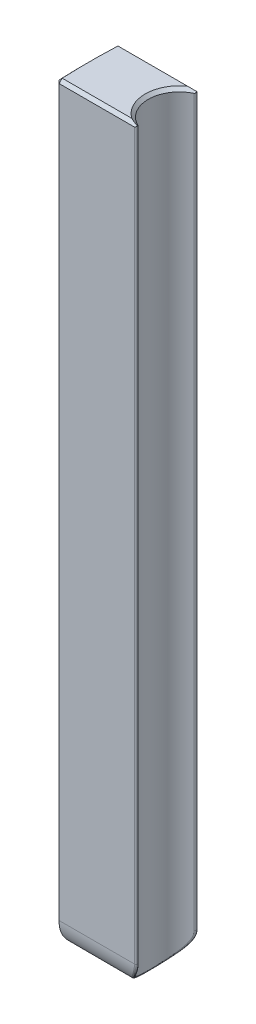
ISO-10303-21;
HEADER;
FILE_DESCRIPTION(('STEP AP214'),'2;1');
FILE_NAME('part.step','',(''),(''),'','','');
FILE_SCHEMA(('AUTOMOTIVE_DESIGN { 1 0 10303 214 1 1 1 1 }'));
ENDSEC;
DATA;
#1=APPLICATION_CONTEXT('core data for automotive mechanical design processes');
#2=APPLICATION_PROTOCOL_DEFINITION('international standard','automotive_design',2000,#1);
#3=PRODUCT_CONTEXT('',#1,'mechanical');
#4=PRODUCT('Part','Part','',(#3));
#5=PRODUCT_RELATED_PRODUCT_CATEGORY('part','',(#4));
#6=PRODUCT_DEFINITION_FORMATION('','',#4);
#7=PRODUCT_DEFINITION_CONTEXT('part definition',#1,'design');
#8=PRODUCT_DEFINITION('design','',#6,#7);
#9=PRODUCT_DEFINITION_SHAPE('','',#8);
#10=(LENGTH_UNIT() NAMED_UNIT(*) SI_UNIT(.MILLI.,.METRE.));
#11=(NAMED_UNIT(*) PLANE_ANGLE_UNIT() SI_UNIT($,.RADIAN.));
#12=(NAMED_UNIT(*) SI_UNIT($,.STERADIAN.) SOLID_ANGLE_UNIT());
#13=UNCERTAINTY_MEASURE_WITH_UNIT(LENGTH_MEASURE(1.E-05),#10,'distance_accuracy_value','');
#14=(GEOMETRIC_REPRESENTATION_CONTEXT(3) GLOBAL_UNCERTAINTY_ASSIGNED_CONTEXT((#13)) GLOBAL_UNIT_ASSIGNED_CONTEXT((#10,
#11,#12)) REPRESENTATION_CONTEXT('',''));
#15=CARTESIAN_POINT('',(0.,0.,0.));
#16=DIRECTION('',(0.,0.,1.));
#17=DIRECTION('',(1.,0.,0.));
#18=AXIS2_PLACEMENT_3D('',#15,#16,#17);
#19=CARTESIAN_POINT('',(3.,0.,0.));
#20=DIRECTION('',(-1.,0.,0.));
#21=DIRECTION('',(0.,0.,1.));
#22=AXIS2_PLACEMENT_3D('',#19,#20,#21);
#23=CYLINDRICAL_SURFACE('',#22,1.);
#24=DIRECTION('',(-1.,0.,0.));
#25=VECTOR('',#24,1.);
#26=CARTESIAN_POINT('',(3.,0.,-1.));
#27=LINE('',#26,#25);
#28=CARTESIAN_POINT('',(2.55278640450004,0.,-1.));
#29=VERTEX_POINT('',#28);
#30=CARTESIAN_POINT('',(0.120362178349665,0.,-1.));
#31=VERTEX_POINT('',#30);
#32=EDGE_CURVE('E155',#29,#31,#27,.T.);
#33=ORIENTED_EDGE('',*,*,#32,.F.);
#34=CARTESIAN_POINT('',(2.4408251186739,0.380428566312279,-0.829049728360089));
#35=CARTESIAN_POINT('',(2.46357478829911,0.401874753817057,-0.844393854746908));
#36=CARTESIAN_POINT('',(2.45319390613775,0.409308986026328,-0.876795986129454));
#37=CARTESIAN_POINT('',(2.4428130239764,0.416743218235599,-0.909198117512));
#38=CARTESIAN_POINT('',(2.41286637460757,0.400451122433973,-0.916318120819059));
#39=CARTESIAN_POINT('',(2.44944747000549,0.366447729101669,-0.834866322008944));
#40=CARTESIAN_POINT('',(2.4728273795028,0.387662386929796,-0.850289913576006));
#41=CARTESIAN_POINT('',(2.46252032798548,0.39490601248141,-0.883087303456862));
#42=CARTESIAN_POINT('',(2.45226780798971,0.402067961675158,-0.915921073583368));
#43=CARTESIAN_POINT('',(2.42191984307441,0.385734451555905,-0.922746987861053));
#44=CARTESIAN_POINT('',(2.45793770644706,0.352251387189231,-0.840395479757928));
#45=CARTESIAN_POINT('',(2.48193520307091,0.373236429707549,-0.855879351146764));
#46=CARTESIAN_POINT('',(2.47173023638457,0.380242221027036,-0.889085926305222));
#47=CARTESIAN_POINT('',(2.46157644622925,0.387163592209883,-0.922324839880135));
#48=CARTESIAN_POINT('',(2.43083459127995,0.370790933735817,-0.928858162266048));
#49=CARTESIAN_POINT('',(2.4745345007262,0.323341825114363,-0.850871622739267));
#50=CARTESIAN_POINT('',(2.49980675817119,0.343756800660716,-0.866484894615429));
#51=CARTESIAN_POINT('',(2.48979966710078,0.350265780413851,-0.900491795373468));
#52=CARTESIAN_POINT('',(2.47984459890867,0.356687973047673,-0.934531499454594));
#53=CARTESIAN_POINT('',(2.44826122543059,0.340359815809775,-0.940437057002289));
#54=CARTESIAN_POINT('',(2.48264027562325,0.308627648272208,-0.855817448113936));
#55=CARTESIAN_POINT('',(2.5085667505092,0.32870006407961,-0.871495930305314));
#56=CARTESIAN_POINT('',(2.49865846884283,0.334951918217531,-0.905897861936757));
#57=CARTESIAN_POINT('',(2.48880031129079,0.341113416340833,-0.940329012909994));
#58=CARTESIAN_POINT('',(2.45677228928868,0.324871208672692,-0.945903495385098));
#59=CARTESIAN_POINT('',(2.50644912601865,0.263091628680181,-0.869913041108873));
#60=CARTESIAN_POINT('',(2.53449624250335,0.281766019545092,-0.88585105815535));
#61=CARTESIAN_POINT('',(2.52480464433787,0.287332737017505,-0.921376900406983));
#62=CARTESIAN_POINT('',(2.51531163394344,0.292535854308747,-0.957021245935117));
#63=CARTESIAN_POINT('',(2.48177158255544,0.276938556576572,-0.961482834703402));
#64=CARTESIAN_POINT('',(2.5213039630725,0.231404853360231,-0.878097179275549));
#65=CARTESIAN_POINT('',(2.55077364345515,0.248925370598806,-0.894181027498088));
#66=CARTESIAN_POINT('',(2.5412952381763,0.253891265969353,-0.930468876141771));
#67=CARTESIAN_POINT('',(2.53195785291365,0.258505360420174,-0.966831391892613));
#68=CARTESIAN_POINT('',(2.49736916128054,0.243584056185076,-0.97052846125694));
#69=CARTESIAN_POINT('',(2.54350144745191,0.173928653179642,-0.88978953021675));
#70=CARTESIAN_POINT('',(2.57544427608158,0.188529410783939,-0.906188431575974));
#71=CARTESIAN_POINT('',(2.56627429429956,0.192291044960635,-0.943625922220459));
#72=CARTESIAN_POINT('',(2.5571854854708,0.195855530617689,-0.981105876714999));
#73=CARTESIAN_POINT('',(2.52067651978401,0.183082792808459,-0.983451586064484));
#74=CARTESIAN_POINT('',(2.5517937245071,0.14870191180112,-0.89395822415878));
#75=CARTESIAN_POINT('',(2.58477453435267,0.161735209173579,-0.910499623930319));
#76=CARTESIAN_POINT('',(2.57573075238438,0.1649667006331,-0.948381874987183));
#77=CARTESIAN_POINT('',(2.5667256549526,0.16804127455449,-0.986283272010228));
#78=CARTESIAN_POINT('',(2.52938341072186,0.156528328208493,-0.988059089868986));
#79=CARTESIAN_POINT('',(2.5647824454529,0.0971287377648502,-0.900355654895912));
#80=CARTESIAN_POINT('',(2.59956423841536,0.106242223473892,-0.917175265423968));
#81=CARTESIAN_POINT('',(2.59068355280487,0.108400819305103,-0.95574680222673));
#82=CARTESIAN_POINT('',(2.58184584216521,0.110407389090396,-0.994339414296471));
#83=CARTESIAN_POINT('',(2.54302156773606,0.102240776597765,-0.995129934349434));
#84=CARTESIAN_POINT('',(2.56950764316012,0.0707931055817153,-0.902599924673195));
#85=CARTESIAN_POINT('',(2.60501462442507,0.077621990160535,-0.919536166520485));
#86=CARTESIAN_POINT('',(2.59621154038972,0.0791767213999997,-0.958372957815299));
#87=CARTESIAN_POINT('',(2.58741660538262,0.0806694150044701,-0.997213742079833));
#88=CARTESIAN_POINT('',(2.54798302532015,0.0745190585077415,-0.997610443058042));
#89=CARTESIAN_POINT('',(2.57338686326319,0.0295202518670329,-0.904434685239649));
#90=CARTESIAN_POINT('',(2.60951226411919,0.0324328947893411,-0.921474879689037));
#91=CARTESIAN_POINT('',(2.60076228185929,0.0330812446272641,-0.960525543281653));
#92=CARTESIAN_POINT('',(2.59201332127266,0.033707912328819,-0.999576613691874));
#93=CARTESIAN_POINT('',(2.55205620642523,0.0310739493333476,-0.999638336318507));
#94=CARTESIAN_POINT('',(2.57408873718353,0.0147652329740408,-0.904763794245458));
#95=CARTESIAN_POINT('',(2.61032997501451,0.0162263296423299,-0.92182383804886));
#96=CARTESIAN_POINT('',(2.6015902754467,0.0165446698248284,-0.960913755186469));
#97=CARTESIAN_POINT('',(2.59284894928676,0.0168642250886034,-1.0000028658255));
#98=CARTESIAN_POINT('',(2.55279317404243,0.0155423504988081,-1.00000208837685));
#99=CARTESIAN_POINT('',(2.57407004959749,-0.0280327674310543,-0.904758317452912));
#100=CARTESIAN_POINT('',(2.61030685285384,-0.0308064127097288,-0.921817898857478));
#101=CARTESIAN_POINT('',(2.60156457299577,-0.0314111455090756,-0.960905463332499));
#102=CARTESIAN_POINT('',(2.59282538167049,-0.0320174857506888,-0.999994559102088));
#103=CARTESIAN_POINT('',(2.55277355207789,-0.029508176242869,-0.999996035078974));
#104=CARTESIAN_POINT('',(2.57150462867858,-0.0561023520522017,-0.903561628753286));
#105=CARTESIAN_POINT('',(2.6073180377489,-0.0615769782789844,-0.920549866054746));
#106=CARTESIAN_POINT('',(2.59853122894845,-0.0628514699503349,-0.959490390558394));
#107=CARTESIAN_POINT('',(2.58977119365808,-0.0639977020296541,-0.998443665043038));
#108=CARTESIAN_POINT('',(2.55007986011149,-0.0590551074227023,-0.998673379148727));
#109=CARTESIAN_POINT('',(2.56188539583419,-0.111205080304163,-0.898933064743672));
#110=CARTESIAN_POINT('',(2.59625065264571,-0.121487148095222,-0.915684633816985));
#111=CARTESIAN_POINT('',(2.58734463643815,-0.123927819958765,-0.95410714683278));
#112=CARTESIAN_POINT('',(2.57845825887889,-0.126243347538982,-0.99253924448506));
#113=CARTESIAN_POINT('',(2.53997966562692,-0.117057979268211,-0.993557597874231));
#114=CARTESIAN_POINT('',(2.55481205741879,-0.138233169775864,-0.895491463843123));
#115=CARTESIAN_POINT('',(2.58819155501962,-0.150515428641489,-0.912095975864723));
#116=CARTESIAN_POINT('',(2.57916911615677,-0.153555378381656,-0.950127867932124));
#117=CARTESIAN_POINT('',(2.57021941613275,-0.156393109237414,-0.988196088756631));
#118=CARTESIAN_POINT('',(2.53255266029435,-0.145508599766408,-0.989753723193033));
#119=CARTESIAN_POINT('',(2.53333321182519,-0.203610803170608,-0.884547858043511));
#120=CARTESIAN_POINT('',(2.56408273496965,-0.219882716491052,-0.900791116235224));
#121=CARTESIAN_POINT('',(2.5547523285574,-0.224356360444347,-0.937687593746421));
#122=CARTESIAN_POINT('',(2.54556810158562,-0.228393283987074,-0.974659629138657));
#123=CARTESIAN_POINT('',(2.509999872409,-0.214327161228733,-0.977658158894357));
#124=CARTESIAN_POINT('',(2.51703351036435,-0.241028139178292,-0.875883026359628));
#125=CARTESIAN_POINT('',(2.54611078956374,-0.258869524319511,-0.891949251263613));
#126=CARTESIAN_POINT('',(2.53652182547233,-0.264084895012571,-0.927986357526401));
#127=CARTESIAN_POINT('',(2.52718826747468,-0.268816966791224,-0.964172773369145));
#128=CARTESIAN_POINT('',(2.49288518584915,-0.253713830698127,-0.968081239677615));
#129=CARTESIAN_POINT('',(2.48101891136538,-0.312865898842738,-0.855041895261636));
#130=CARTESIAN_POINT('',(2.50685243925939,-0.332953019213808,-0.870750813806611));
#131=CARTESIAN_POINT('',(2.49681625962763,-0.339494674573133,-0.905011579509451));
#132=CARTESIAN_POINT('',(2.48704673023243,-0.345528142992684,-0.939425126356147));
#133=CARTESIAN_POINT('',(2.4550698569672,-0.329332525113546,-0.945046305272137));
#134=CARTESIAN_POINT('',(2.46129078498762,-0.347273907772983,-0.842851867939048));
#135=CARTESIAN_POINT('',(2.48561888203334,-0.368042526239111,-0.85843851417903));
#136=CARTESIAN_POINT('',(2.475328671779,-0.375159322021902,-0.891724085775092));
#137=CARTESIAN_POINT('',(2.46533899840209,-0.381809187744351,-0.925213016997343));
#138=CARTESIAN_POINT('',(2.43435532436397,-0.365551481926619,-0.931573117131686));
#139=CARTESIAN_POINT('',(2.42303286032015,-0.409252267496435,-0.817050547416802));
#140=CARTESIAN_POINT('',(2.44465155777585,-0.430917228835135,-0.832337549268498));
#141=CARTESIAN_POINT('',(2.43395058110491,-0.438997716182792,-0.863817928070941));
#142=CARTESIAN_POINT('',(2.42347613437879,-0.446731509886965,-0.895450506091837));
#143=CARTESIAN_POINT('',(2.39418450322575,-0.430791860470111,-0.903055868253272));
#144=CARTESIAN_POINT('',(2.40468316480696,-0.437128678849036,-0.803832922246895));
#145=CARTESIAN_POINT('',(2.42512888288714,-0.459036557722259,-0.81900330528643));
#146=CARTESIAN_POINT('',(2.41421811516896,-0.4675414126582,-0.84959989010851));
#147=CARTESIAN_POINT('',(2.40353407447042,-0.475730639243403,-0.880372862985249));
#148=CARTESIAN_POINT('',(2.37491732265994,-0.460135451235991,-0.888446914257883));
#149=CARTESIAN_POINT('',(2.36760320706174,-0.49119078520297,-0.775001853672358));
#150=CARTESIAN_POINT('',(2.3858135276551,-0.513382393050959,-0.789882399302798));
#151=CARTESIAN_POINT('',(2.3744892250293,-0.522706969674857,-0.818709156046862));
#152=CARTESIAN_POINT('',(2.36339244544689,-0.531716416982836,-0.84771272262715));
#153=CARTESIAN_POINT('',(2.33598336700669,-0.517042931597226,-0.856580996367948));
#154=CARTESIAN_POINT('',(2.34887271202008,-0.51737540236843,-0.759386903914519));
#155=CARTESIAN_POINT('',(2.36601723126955,-0.539638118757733,-0.774117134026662));
#156=CARTESIAN_POINT('',(2.35449264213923,-0.54932760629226,-0.802034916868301));
#157=CARTESIAN_POINT('',(2.34318899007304,-0.558733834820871,-0.830151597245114));
#158=CARTESIAN_POINT('',(2.31631634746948,-0.544605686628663,-0.839322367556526));
#159=CARTESIAN_POINT('',(2.29298142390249,-0.5934350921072,-0.708965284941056));
#160=CARTESIAN_POINT('',(2.30737629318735,-0.61533788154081,-0.723391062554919));
#161=CARTESIAN_POINT('',(2.29495328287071,-0.626494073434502,-0.748323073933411));
#162=CARTESIAN_POINT('',(2.28337046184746,-0.636555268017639,-0.77401385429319));
#163=CARTESIAN_POINT('',(2.25763049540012,-0.624668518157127,-0.783593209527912));
#164=CARTESIAN_POINT('',(2.25603275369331,-0.640948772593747,-0.670526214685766));
#165=CARTESIAN_POINT('',(2.26848162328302,-0.662845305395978,-0.684505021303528));
#166=CARTESIAN_POINT('',(2.25576626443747,-0.674480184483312,-0.707536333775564));
#167=CARTESIAN_POINT('',(2.2437318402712,-0.685294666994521,-0.731418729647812));
#168=CARTESIAN_POINT('',(2.21883439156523,-0.674682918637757,-0.741107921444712));
#169=CARTESIAN_POINT('',(2.19469585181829,-0.717841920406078,-0.594360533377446));
#170=CARTESIAN_POINT('',(2.20398966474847,-0.739611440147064,-0.607005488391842));
#171=CARTESIAN_POINT('',(2.19082752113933,-0.752010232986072,-0.626896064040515));
#172=CARTESIAN_POINT('',(2.17805905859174,-0.76394453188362,-0.647271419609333));
#173=CARTESIAN_POINT('',(2.15443064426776,-0.755623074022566,-0.656924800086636));
#174=CARTESIAN_POINT('',(2.16944880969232,-0.748811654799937,-0.558768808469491));
#175=CARTESIAN_POINT('',(2.17748326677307,-0.770495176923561,-0.570822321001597));
#176=CARTESIAN_POINT('',(2.16413702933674,-0.783191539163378,-0.589264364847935));
#177=CARTESIAN_POINT('',(2.15108487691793,-0.795549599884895,-0.6081904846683));
#178=CARTESIAN_POINT('',(2.12792124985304,-0.788222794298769,-0.617586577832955));
#179=CARTESIAN_POINT('',(2.1226096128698,-0.805557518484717,-0.48187310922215));
#180=CARTESIAN_POINT('',(2.12842178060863,-0.826951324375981,-0.492532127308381));
#181=CARTESIAN_POINT('',(2.1146584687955,-0.840280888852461,-0.508036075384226));
#182=CARTESIAN_POINT('',(2.1011814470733,-0.853279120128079,-0.524008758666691));
#183=CARTESIAN_POINT('',(2.07874009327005,-0.847955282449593,-0.532596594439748));
#184=CARTESIAN_POINT('',(2.10101113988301,-0.831342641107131,-0.440579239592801));
#185=CARTESIAN_POINT('',(2.10576294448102,-0.852653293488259,-0.450422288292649));
#186=CARTESIAN_POINT('',(2.09186365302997,-0.86619806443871,-0.464450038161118));
#187=CARTESIAN_POINT('',(2.07814632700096,-0.879536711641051,-0.478900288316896));
#188=CARTESIAN_POINT('',(2.05606169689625,-0.875097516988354,-0.486956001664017));
#189=CARTESIAN_POINT('',(2.0667728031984,-0.87192328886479,-0.361338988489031));
#190=CARTESIAN_POINT('',(2.06990306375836,-0.89303606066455,-0.369503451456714));
#191=CARTESIAN_POINT('',(2.05574386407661,-0.906969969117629,-0.380855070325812));
#192=CARTESIAN_POINT('',(2.04170343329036,-0.920770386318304,-0.392480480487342));
#193=CARTESIAN_POINT('',(2.02011144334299,-0.917813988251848,-0.399374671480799));
#194=CARTESIAN_POINT('',(2.0532062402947,-0.887883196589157,-0.324337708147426));
#195=CARTESIAN_POINT('',(2.05568325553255,-0.908931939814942,-0.331698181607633));
#196=CARTESIAN_POINT('',(2.04143790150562,-0.922998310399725,-0.341835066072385));
#197=CARTESIAN_POINT('',(2.02725744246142,-0.936992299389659,-0.352191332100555));
#198=CARTESIAN_POINT('',(2.00586655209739,-0.934613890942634,-0.358478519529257));
#199=CARTESIAN_POINT('',(2.03028390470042,-0.914751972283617,-0.24749267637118));
#200=CARTESIAN_POINT('',(2.03170494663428,-0.935640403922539,-0.253191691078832));
#201=CARTESIAN_POINT('',(2.0172710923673,-0.949976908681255,-0.260818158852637));
#202=CARTESIAN_POINT('',(2.0029022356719,-0.964240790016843,-0.268660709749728));
#203=CARTESIAN_POINT('',(1.98179809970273,-0.962896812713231,-0.273544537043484));
#204=CARTESIAN_POINT('',(2.0209221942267,-0.925667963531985,-0.207653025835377));
#205=CARTESIAN_POINT('',(2.0218923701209,-0.946513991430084,-0.21243156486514));
#206=CARTESIAN_POINT('',(2.00740397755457,-0.96093432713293,-0.21882555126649));
#207=CARTESIAN_POINT('',(1.99293805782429,-0.975329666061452,-0.225355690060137));
#208=CARTESIAN_POINT('',(1.97196830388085,-0.974387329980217,-0.229511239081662));
#209=CARTESIAN_POINT('',(2.0070738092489,-0.941790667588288,-0.125814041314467));
#210=CARTESIAN_POINT('',(2.00740965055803,-0.962538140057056,-0.128755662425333));
#211=CARTESIAN_POINT('',(1.99280916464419,-0.977116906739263,-0.132575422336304));
#212=CARTESIAN_POINT('',(1.97823284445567,-0.991668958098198,-0.13653463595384));
#213=CARTESIAN_POINT('',(1.9574274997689,-0.991358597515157,-0.139057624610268));
#214=CARTESIAN_POINT('',(2.0026194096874,-0.946959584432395,-0.0838022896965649));
#215=CARTESIAN_POINT('',(2.00273990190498,-0.967688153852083,-0.0857358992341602));
#216=CARTESIAN_POINT('',(1.98811549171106,-0.982304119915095,-0.0883048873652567));
#217=CARTESIAN_POINT('',(1.97349221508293,-0.996918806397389,-0.0909084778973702));
#218=CARTESIAN_POINT('',(1.95275038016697,-0.996799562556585,-0.0926235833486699));
#219=CARTESIAN_POINT('',(1.9991071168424,-0.95103654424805,0.000717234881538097));
#220=CARTESIAN_POINT('',(1.99906714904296,-0.971739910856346,0.000714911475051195));
#221=CARTESIAN_POINT('',(1.98441447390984,-0.986395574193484,0.000756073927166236));
#222=CARTESIAN_POINT('',(1.96976364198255,-1.00104922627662,0.000760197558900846));
#223=CARTESIAN_POINT('',(1.9490624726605,-1.00109109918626,0.000792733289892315));
#224=CARTESIAN_POINT('',(2.00004733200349,-0.949946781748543,0.0432248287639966));
#225=CARTESIAN_POINT('',(2.00005307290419,-0.970653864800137,0.0442521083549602));
#226=CARTESIAN_POINT('',(1.98540513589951,-0.985302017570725,0.0455463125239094));
#227=CARTESIAN_POINT('',(1.97076445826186,-0.99994224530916,0.0469152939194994));
#228=CARTESIAN_POINT('',(1.95004969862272,-0.999943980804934,0.0477748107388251));
#229=CARTESIAN_POINT('',(2.00686747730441,-0.942025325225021,0.122994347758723));
#230=CARTESIAN_POINT('',(2.00718402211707,-0.962782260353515,0.125830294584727));
#231=CARTESIAN_POINT('',(1.99259197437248,-0.977352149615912,0.129604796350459));
#232=CARTESIAN_POINT('',(1.97800404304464,-0.991917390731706,0.133436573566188));
#233=CARTESIAN_POINT('',(1.95721085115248,-0.99160560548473,0.135941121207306));
#234=CARTESIAN_POINT('',(2.01224315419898,-0.935779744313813,0.160355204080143));
#235=CARTESIAN_POINT('',(2.01281669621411,-0.956562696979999,0.164070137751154));
#236=CARTESIAN_POINT('',(1.99825676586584,-0.971084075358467,0.168976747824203));
#237=CARTESIAN_POINT('',(1.98372263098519,-0.985576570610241,0.174009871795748));
#238=CARTESIAN_POINT('',(1.96285531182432,-0.985031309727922,0.177234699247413));
#239=CARTESIAN_POINT('',(2.02688972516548,-0.918704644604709,0.233345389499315));
#240=CARTESIAN_POINT('',(2.02813604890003,-0.93959052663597,0.238691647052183));
#241=CARTESIAN_POINT('',(2.01369394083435,-0.953944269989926,0.245906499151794));
#242=CARTESIAN_POINT('',(1.99927837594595,-0.968268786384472,0.253255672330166));
#243=CARTESIAN_POINT('',(1.97823421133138,-0.96705752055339,0.257908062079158));
#244=CARTESIAN_POINT('',(2.03616672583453,-0.907867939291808,0.268971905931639));
#245=CARTESIAN_POINT('',(2.03785690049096,-0.928799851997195,0.275132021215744));
#246=CARTESIAN_POINT('',(2.02347276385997,-0.943065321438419,0.283461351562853));
#247=CARTESIAN_POINT('',(2.00915024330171,-0.957262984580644,0.291990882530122));
#248=CARTESIAN_POINT('',(1.98797506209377,-0.955650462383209,0.297284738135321));
#249=CARTESIAN_POINT('',(2.07015499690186,-0.86797875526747,0.375640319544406));
#250=CARTESIAN_POINT('',(2.0735103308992,-0.889036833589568,0.384375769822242));
#251=CARTESIAN_POINT('',(2.05930860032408,-0.903010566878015,0.395929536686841));
#252=CARTESIAN_POINT('',(2.04536670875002,-0.916691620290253,0.408284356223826));
#253=CARTESIAN_POINT('',(2.02366274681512,-0.913661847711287,0.4151814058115));
#254=CARTESIAN_POINT('',(2.1006261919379,-0.831992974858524,0.442595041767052));
#255=CARTESIAN_POINT('',(2.10557632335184,-0.853047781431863,0.452803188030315));
#256=CARTESIAN_POINT('',(2.09144703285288,-0.866863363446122,0.466563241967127));
#257=CARTESIAN_POINT('',(2.07795026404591,-0.879951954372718,0.481381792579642));
#258=CARTESIAN_POINT('',(2.0556575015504,-0.875782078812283,0.489183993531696));
#259=CARTESIAN_POINT('',(2.16219031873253,-0.757709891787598,0.548582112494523));
#260=CARTESIAN_POINT('',(2.16991829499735,-0.779303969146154,0.560557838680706));
#261=CARTESIAN_POINT('',(2.15646386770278,-0.792150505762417,0.578493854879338));
#262=CARTESIAN_POINT('',(2.14338663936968,-0.804563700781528,0.597102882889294));
#263=CARTESIAN_POINT('',(2.12029983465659,-0.797589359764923,0.606327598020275));
#264=CARTESIAN_POINT('',(2.19145555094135,-0.721941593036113,0.59047892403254));
#265=CARTESIAN_POINT('',(2.20065347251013,-0.74361772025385,0.603147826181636));
#266=CARTESIAN_POINT('',(2.18739478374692,-0.756147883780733,0.622784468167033));
#267=CARTESIAN_POINT('',(2.17466139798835,-0.768050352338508,0.643076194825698));
#268=CARTESIAN_POINT('',(2.15102832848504,-0.759938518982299,0.652634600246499));
#269=CARTESIAN_POINT('',(2.25310044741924,-0.644585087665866,0.666737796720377));
#270=CARTESIAN_POINT('',(2.26533711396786,-0.666550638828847,0.680566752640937));
#271=CARTESIAN_POINT('',(2.25266406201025,-0.678142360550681,0.703527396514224));
#272=CARTESIAN_POINT('',(2.24053015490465,-0.689089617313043,0.727149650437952));
#273=CARTESIAN_POINT('',(2.21575546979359,-0.678510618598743,0.736920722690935));
#274=CARTESIAN_POINT('',(2.28549128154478,-0.602975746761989,0.701071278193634));
#275=CARTESIAN_POINT('',(2.29942434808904,-0.624966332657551,0.715324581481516));
#276=CARTESIAN_POINT('',(2.28701465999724,-0.63611765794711,0.739949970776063));
#277=CARTESIAN_POINT('',(2.2752664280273,-0.646431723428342,0.765183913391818));
#278=CARTESIAN_POINT('',(2.24976584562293,-0.634711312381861,0.774868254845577));
#279=CARTESIAN_POINT('',(2.35195038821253,-0.513655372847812,0.762976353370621));
#280=CARTESIAN_POINT('',(2.36946899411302,-0.535648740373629,0.777970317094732));
#281=CARTESIAN_POINT('',(2.35774241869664,-0.545594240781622,0.805832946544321));
#282=CARTESIAN_POINT('',(2.34670454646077,-0.554648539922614,0.834345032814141));
#283=CARTESIAN_POINT('',(2.31954790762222,-0.540689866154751,0.843289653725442));
#284=CARTESIAN_POINT('',(2.38604030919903,-0.465820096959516,0.790362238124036));
#285=CARTESIAN_POINT('',(2.40552098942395,-0.487624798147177,0.805556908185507));
#286=CARTESIAN_POINT('',(2.39414858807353,-0.496962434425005,0.835101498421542));
#287=CARTESIAN_POINT('',(2.38350548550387,-0.505217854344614,0.865169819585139));
#288=CARTESIAN_POINT('',(2.35534232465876,-0.490336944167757,0.873558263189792));
#289=CARTESIAN_POINT('',(2.43525185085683,-0.389826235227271,0.825511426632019));
#290=CARTESIAN_POINT('',(2.45768460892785,-0.411291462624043,0.840879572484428));
#291=CARTESIAN_POINT('',(2.44714292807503,-0.419020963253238,0.872951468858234));
#292=CARTESIAN_POINT('',(2.4367920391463,-0.426474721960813,0.905158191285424));
#293=CARTESIAN_POINT('',(2.40701444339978,-0.410343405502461,0.91240736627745));
#294=CARTESIAN_POINT('',(2.45131872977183,-0.363818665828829,0.836231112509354));
#295=CARTESIAN_POINT('',(2.47486802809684,-0.384930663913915,0.851700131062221));
#296=CARTESIAN_POINT('',(2.46452055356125,-0.392239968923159,0.884549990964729));
#297=CARTESIAN_POINT('',(2.45435234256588,-0.399253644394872,0.917512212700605));
#298=CARTESIAN_POINT('',(2.42388466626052,-0.382967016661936,0.924255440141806));
#299=CARTESIAN_POINT('',(2.48208887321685,-0.310143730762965,0.855626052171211));
#300=CARTESIAN_POINT('',(2.50800584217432,-0.330193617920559,0.871335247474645));
#301=CARTESIAN_POINT('',(2.49802785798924,-0.336576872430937,0.905670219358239));
#302=CARTESIAN_POINT('',(2.48822573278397,-0.342665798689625,0.940116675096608));
#303=CARTESIAN_POINT('',(2.45619331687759,-0.326467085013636,0.945691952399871));
#304=CARTESIAN_POINT('',(2.49679392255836,-0.282478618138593,0.864304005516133));
#305=CARTESIAN_POINT('',(2.52394445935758,-0.301805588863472,0.880128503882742));
#306=CARTESIAN_POINT('',(2.51415916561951,-0.307697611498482,0.91519466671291));
#307=CARTESIAN_POINT('',(2.50452277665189,-0.313286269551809,0.950344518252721));
#308=CARTESIAN_POINT('',(2.47163361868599,-0.297345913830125,0.955283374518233));
#309=CARTESIAN_POINT('',(2.52223938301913,-0.228343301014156,0.878597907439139));
#310=CARTESIAN_POINT('',(2.55181622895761,-0.245708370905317,0.894696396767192));
#311=CARTESIAN_POINT('',(2.54236007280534,-0.250557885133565,0.931036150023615));
#312=CARTESIAN_POINT('',(2.5330234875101,-0.25516661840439,0.967443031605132));
#313=CARTESIAN_POINT('',(2.49835135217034,-0.240361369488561,0.971081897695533));
#314=CARTESIAN_POINT('',(2.53323836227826,-0.202079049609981,0.884446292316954));
#315=CARTESIAN_POINT('',(2.56398071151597,-0.21824845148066,0.900681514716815));
#316=CARTESIAN_POINT('',(2.55468154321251,-0.222581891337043,0.937591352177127));
#317=CARTESIAN_POINT('',(2.54546346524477,-0.226690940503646,0.974542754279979));
#318=CARTESIAN_POINT('',(2.50990028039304,-0.212714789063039,0.977545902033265));
#319=CARTESIAN_POINT('',(2.55201365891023,-0.147966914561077,0.894102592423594));
#320=CARTESIAN_POINT('',(2.58502449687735,-0.160925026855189,0.910653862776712));
#321=CARTESIAN_POINT('',(2.57596299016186,-0.164172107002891,0.948535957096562));
#322=CARTESIAN_POINT('',(2.56698128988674,-0.167201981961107,0.986459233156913));
#323=CARTESIAN_POINT('',(2.52961434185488,-0.155754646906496,0.988218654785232));
#324=CARTESIAN_POINT('',(2.55980202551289,-0.120125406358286,0.897918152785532));
#325=CARTESIAN_POINT('',(2.59387021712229,-0.131110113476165,0.914623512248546));
#326=CARTESIAN_POINT('',(2.58493552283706,-0.13374802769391,0.952933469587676));
#327=CARTESIAN_POINT('',(2.57602478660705,-0.136238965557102,0.991255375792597));
#328=CARTESIAN_POINT('',(2.53779212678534,-0.126447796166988,0.992435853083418));
#329=CARTESIAN_POINT('',(2.57096461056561,-0.0615693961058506,0.90331309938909));
#330=CARTESIAN_POINT('',(2.60668907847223,-0.0675543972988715,0.920286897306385));
#331=CARTESIAN_POINT('',(2.5978895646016,-0.0689640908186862,0.959194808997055));
#332=CARTESIAN_POINT('',(2.58912851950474,-0.0702101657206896,0.998120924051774));
#333=CARTESIAN_POINT('',(2.54951284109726,-0.0648098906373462,0.998398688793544));
#334=CARTESIAN_POINT('',(2.57407752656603,-0.0307809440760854,0.904760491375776));
#335=CARTESIAN_POINT('',(2.61031632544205,-0.0338213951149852,0.921820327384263));
#336=CARTESIAN_POINT('',(2.60157513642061,-0.034480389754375,0.960908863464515));
#337=CARTESIAN_POINT('',(2.59283502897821,-0.0351510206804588,0.999997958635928));
#338=CARTESIAN_POINT('',(2.5527814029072,-0.0324009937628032,0.999998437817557));
#339=CARTESIAN_POINT('',(2.5740866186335,0.0279712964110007,0.904763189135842));
#340=CARTESIAN_POINT('',(2.61032715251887,0.0307343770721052,0.921823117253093));
#341=CARTESIAN_POINT('',(2.60158710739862,0.0313330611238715,0.960912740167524));
#342=CARTESIAN_POINT('',(2.59284607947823,0.0319426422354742,1.00000185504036));
#343=CARTESIAN_POINT('',(2.55279094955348,0.0294434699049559,1.0000014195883));
#344=CARTESIAN_POINT('',(2.57152431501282,0.0559363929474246,0.903570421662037));
#345=CARTESIAN_POINT('',(2.60734092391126,0.0613934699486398,0.920559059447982));
#346=CARTESIAN_POINT('',(2.59855453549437,0.0626633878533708,0.959500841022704));
#347=CARTESIAN_POINT('',(2.58979458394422,0.0638070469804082,0.99845498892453));
#348=CARTESIAN_POINT('',(2.5501005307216,0.0588804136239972,0.998683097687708));
#349=CARTESIAN_POINT('',(2.56192425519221,0.11103670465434,0.898952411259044));
#350=CARTESIAN_POINT('',(2.5962950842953,0.121307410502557,0.91570498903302));
#351=CARTESIAN_POINT('',(2.58738949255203,0.123745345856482,0.954129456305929));
#352=CARTESIAN_POINT('',(2.5785036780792,0.126056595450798,0.992563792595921));
#353=CARTESIAN_POINT('',(2.54002046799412,0.116880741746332,0.993578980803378));
#354=CARTESIAN_POINT('',(2.55484001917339,0.138160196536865,0.895503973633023));
#355=CARTESIAN_POINT('',(2.58822426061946,0.150441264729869,0.912109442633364));
#356=CARTESIAN_POINT('',(2.57920406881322,0.153477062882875,0.95014350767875));
#357=CARTESIAN_POINT('',(2.57025279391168,0.15631590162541,0.988212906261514));
#358=CARTESIAN_POINT('',(2.53258202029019,0.14543178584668,0.98976754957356));
#359=CARTESIAN_POINT('',(2.53965702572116,0.184353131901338,0.887771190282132));
#360=CARTESIAN_POINT('',(2.57113654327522,0.199572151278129,0.904100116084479));
#361=CARTESIAN_POINT('',(2.56193874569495,0.203500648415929,0.941350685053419));
#362=CARTESIAN_POINT('',(2.55278068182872,0.2073119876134,0.978621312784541));
#363=CARTESIAN_POINT('',(2.51663987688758,0.194055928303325,0.981220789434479));
#364=CARTESIAN_POINT('',(2.5322365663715,0.203762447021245,0.88390117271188));
#365=CARTESIAN_POINT('',(2.56287355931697,0.220000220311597,0.900121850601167));
#366=CARTESIAN_POINT('',(2.55357425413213,0.224315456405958,0.936986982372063));
#367=CARTESIAN_POINT('',(2.54433097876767,0.228504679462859,0.973882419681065));
#368=CARTESIAN_POINT('',(2.50884839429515,0.214486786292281,0.976943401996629));
#369=CARTESIAN_POINT('',(2.51610339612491,0.241755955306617,0.875173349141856));
#370=CARTESIAN_POINT('',(2.5450476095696,0.259702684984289,0.891183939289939));
#371=CARTESIAN_POINT('',(2.53554696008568,0.264747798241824,0.92723441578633));
#372=CARTESIAN_POINT('',(2.52610217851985,0.269667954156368,0.963315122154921));
#373=CARTESIAN_POINT('',(2.49190856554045,0.254479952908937,0.967296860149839));
#374=CARTESIAN_POINT('',(2.50738873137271,0.260338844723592,0.870314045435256));
#375=CARTESIAN_POINT('',(2.53549670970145,0.278969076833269,0.886231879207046));
#376=CARTESIAN_POINT('',(2.52588219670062,0.284363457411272,0.921843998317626));
#377=CARTESIAN_POINT('',(2.51633542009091,0.289630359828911,0.957495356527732));
#378=CARTESIAN_POINT('',(2.48275816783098,0.274040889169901,0.96192605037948));
#379=CARTESIAN_POINT('',(2.48931279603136,0.296244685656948,0.859828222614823));
#380=CARTESIAN_POINT('',(2.51580122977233,0.315992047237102,0.875568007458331));
#381=CARTESIAN_POINT('',(2.50596730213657,0.322038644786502,0.910291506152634));
#382=CARTESIAN_POINT('',(2.49619681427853,0.327964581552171,0.945051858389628));
#383=CARTESIAN_POINT('',(2.46377843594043,0.311836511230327,0.950336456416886));
#384=CARTESIAN_POINT('',(2.47997390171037,0.313587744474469,0.85422463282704));
#385=CARTESIAN_POINT('',(2.50568836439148,0.33377193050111,0.86988720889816));
#386=CARTESIAN_POINT('',(2.49573860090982,0.340125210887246,0.904152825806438));
#387=CARTESIAN_POINT('',(2.48585733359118,0.346361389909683,0.938461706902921));
#388=CARTESIAN_POINT('',(2.45397259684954,0.330092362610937,0.94414301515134));
#389=CARTESIAN_POINT('',(2.46075113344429,0.347528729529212,0.842223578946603));
#390=CARTESIAN_POINT('',(2.48496395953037,0.368419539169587,0.857733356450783));
#391=CARTESIAN_POINT('',(2.47478244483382,0.375361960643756,0.89106950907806));
#392=CARTESIAN_POINT('',(2.464672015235,0.382186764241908,0.924449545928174));
#393=CARTESIAN_POINT('',(2.43378869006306,0.3658197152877,0.930878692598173));
#394=CARTESIAN_POINT('',(2.45086949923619,0.364129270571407,0.835829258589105));
#395=CARTESIAN_POINT('',(2.47435984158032,0.385293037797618,0.851269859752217));
#396=CARTESIAN_POINT('',(2.46405706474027,0.392515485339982,0.884128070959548));
#397=CARTESIAN_POINT('',(2.45383372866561,0.399621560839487,0.917037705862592));
#398=CARTESIAN_POINT('',(2.42341297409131,0.38329396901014,0.9238112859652));
#399=CARTESIAN_POINT('',(2.4408251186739,0.380428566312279,0.829049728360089));
#400=CARTESIAN_POINT('',(2.46357478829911,0.401874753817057,0.844393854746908));
#401=CARTESIAN_POINT('',(2.45319390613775,0.409308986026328,0.876795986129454));
#402=CARTESIAN_POINT('',(2.4428130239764,0.416743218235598,0.909198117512));
#403=CARTESIAN_POINT('',(2.41286637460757,0.400451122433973,0.916318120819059));
#404=(BOUNDED_SURFACE() B_SPLINE_SURFACE(3,2,((#34,#35,#36,#37,#38),(#39,#40,#41,#42,#43),(#44,
#45,#46,#47,#48),(#49,#50,#51,#52,#53),(#54,#55,#56,#57,#58),(#59,#60,#61,#62,#63),(#64,#65,#66,
#67,#68),(#69,#70,#71,#72,#73),(#74,#75,#76,#77,#78),(#79,#80,#81,#82,#83),(#84,#85,#86,#87,
#88),(#89,#90,#91,#92,#93),(#94,#95,#96,#97,#98),(#99,#100,#101,#102,#103),(#104,#105,#106,#107,
#108),(#109,#110,#111,#112,#113),(#114,#115,#116,#117,#118),(#119,#120,#121,#122,#123),(#124,
#125,#126,#127,#128),(#129,#130,#131,#132,#133),(#134,#135,#136,#137,#138),(#139,#140,#141,#142,
#143),(#144,#145,#146,#147,#148),(#149,#150,#151,#152,#153),(#154,#155,#156,#157,#158),(#159,
#160,#161,#162,#163),(#164,#165,#166,#167,#168),(#169,#170,#171,#172,#173),(#174,#175,#176,#177,
#178),(#179,#180,#181,#182,#183),(#184,#185,#186,#187,#188),(#189,#190,#191,#192,#193),(#194,
#195,#196,#197,#198),(#199,#200,#201,#202,#203),(#204,#205,#206,#207,#208),(#209,#210,#211,#212,
#213),(#214,#215,#216,#217,#218),(#219,#220,#221,#222,#223),(#224,#225,#226,#227,#228),(#229,
#230,#231,#232,#233),(#234,#235,#236,#237,#238),(#239,#240,#241,#242,#243),(#244,#245,#246,#247,
#248),(#249,#250,#251,#252,#253),(#254,#255,#256,#257,#258),(#259,#260,#261,#262,#263),(#264,
#265,#266,#267,#268),(#269,#270,#271,#272,#273),(#274,#275,#276,#277,#278),(#279,#280,#281,#282,
#283),(#284,#285,#286,#287,#288),(#289,#290,#291,#292,#293),(#294,#295,#296,#297,#298),(#299,
#300,#301,#302,#303),(#304,#305,#306,#307,#308),(#309,#310,#311,#312,#313),(#314,#315,#316,#317,
#318),(#319,#320,#321,#322,#323),(#324,#325,#326,#327,#328),(#329,#330,#331,#332,#333),(#334,
#335,#336,#337,#338),(#339,#340,#341,#342,#343),(#344,#345,#346,#347,#348),(#349,#350,#351,#352,
#353),(#354,#355,#356,#357,#358),(#359,#360,#361,#362,#363),(#364,#365,#366,#367,#368),(#369,
#370,#371,#372,#373),(#374,#375,#376,#377,#378),(#379,#380,#381,#382,#383),(#384,#385,#386,#387,
#388),(#389,#390,#391,#392,#393),(#394,#395,#396,#397,#398),(#399,#400,#401,#402,#403)),
.UNSPECIFIED.,.F.,.F.,.F.) B_SPLINE_SURFACE_WITH_KNOTS((4,2,2,2,2,2,2,2,2,2,2,2,2,2,2,2,2,2,2,2,
2,2,2,2,2,2,2,2,2,2,2,2,2,2,2,2,4),(3,2,3),(0.,0.0532048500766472,0.10651376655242,
0.215161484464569,0.296039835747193,0.376259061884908,0.420520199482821,0.504552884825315,
0.588952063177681,0.714652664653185,0.840849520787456,0.950561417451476,1.06034253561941,
1.27939436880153,1.44475272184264,1.60982171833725,1.74234681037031,1.87468416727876,
2.0078867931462,2.14104271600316,2.26086020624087,2.38086594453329,2.63269903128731,
2.82537123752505,3.01875946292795,3.21687273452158,3.31571487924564,3.41442559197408,
3.50222490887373,3.58969165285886,3.68188538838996,3.76566379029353,3.85031750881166,
3.91414610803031,3.97807206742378,4.04035498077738,4.10239778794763),(0.,0.5,1.),
.UNSPECIFIED.) GEOMETRIC_REPRESENTATION_ITEM() RATIONAL_B_SPLINE_SURFACE(((1.,0.820562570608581,
1.,0.820562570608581,1.),(1.,0.81822071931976,1.,0.81822071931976,1.),(1.,0.815880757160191,1.,
0.815880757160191,1.),(1.,0.81123443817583,1.,0.81123443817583,1.),(1.,0.80892815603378,1.,
0.80892815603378,1.),(1.,0.802032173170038,1.,0.802032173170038,1.),(1.,0.797557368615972,1.,
0.797557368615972,1.),(1.,0.790619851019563,1.,0.790619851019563,1.),(1.,0.787935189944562,1.,
0.787935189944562,1.),(1.,0.78364354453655,1.,0.78364354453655,1.),(1.,0.782027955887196,1.,
0.782027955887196,1.),(1.,0.780694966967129,1.,0.780694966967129,1.),(1.,0.780451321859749,1.,
0.780451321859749,1.),(1.,0.780460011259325,1.,0.780460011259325,1.),(1.,0.781354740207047,1.,
0.781354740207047,1.),(1.,0.784603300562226,1.,0.784603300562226,1.),(1.,0.786963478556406,1.,
0.786963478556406,1.),(1.,0.793853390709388,1.,0.793853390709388,1.),(1.,0.798879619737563,1.,
0.798879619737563,1.),(1.,0.809453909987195,1.,0.809453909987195,1.),(1.,0.815003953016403,1.,
0.815003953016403,1.),(1.,0.825395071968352,1.,0.825395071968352,1.),(1.,0.830234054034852,1.,
0.830234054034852,1.),(1.,0.839781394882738,1.,0.839781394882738,1.),(1.,0.844489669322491,1.,
0.844489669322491,1.),(1.,0.858273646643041,1.,0.858273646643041,1.),(1.,0.86703187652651,1.,
0.86703187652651,1.),(1.,0.881218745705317,1.,0.881218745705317,1.),(1.,0.886937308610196,1.,
0.886937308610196,1.),(1.,0.897401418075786,1.,0.897401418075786,1.),(1.,0.902148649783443,1.,
0.902148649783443,1.),(1.,0.909603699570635,1.,0.909603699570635,1.),(1.,0.91252907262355,1.,
0.91252907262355,1.),(1.,0.917447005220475,1.,0.917447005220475,1.),(1.,0.919440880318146,1.,
0.919440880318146,1.),(1.,0.92238354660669,1.,0.92238354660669,1.),(1.,0.923325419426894,1.,
0.923325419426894,1.),(1.,0.924068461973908,1.,0.924068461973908,1.),(1.,0.92387003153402,1.,
0.92387003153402,1.),(1.,0.922425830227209,1.,0.922425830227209,1.),(1.,0.921286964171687,1.,
0.921286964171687,1.),(1.,0.918168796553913,1.,0.918168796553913,1.),(1.,0.916188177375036,1.,
0.916188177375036,1.),(1.,0.908882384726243,1.,0.908882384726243,1.),(1.,0.902273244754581,1.,
0.902273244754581,1.),(1.,0.8885798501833,1.,0.8885798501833,1.),(1.,0.8819719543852,1.,
0.8819719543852,1.),(1.,0.867706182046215,1.,0.867706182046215,1.),(1.,0.860044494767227,1.,
0.860044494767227,1.),(1.,0.843784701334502,1.,0.843784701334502,1.),(1.,0.83516828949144,1.,
0.83516828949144,1.),(1.,0.82210833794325,1.,0.82210833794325,1.),(1.,0.817737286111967,1.,
0.817737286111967,1.),(1.,0.809115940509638,1.,0.809115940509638,1.),(1.,0.804865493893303,1.,
0.804865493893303,1.),(1.,0.797260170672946,1.,0.797260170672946,1.),(1.,0.793858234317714,1.,
0.793858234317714,1.),(1.,0.787878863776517,1.,0.787878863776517,1.),(1.,0.785298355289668,1.,
0.785298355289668,1.),(1.,0.781545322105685,1.,0.781545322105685,1.),(1.,0.780456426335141,1.,
0.780456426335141,1.),(1.,0.780452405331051,1.,0.780452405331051,1.),(1.,0.781347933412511,1.,
0.781347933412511,1.),(1.,0.784590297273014,1.,0.784590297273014,1.),(1.,0.786952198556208,1.,
0.786952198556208,1.),(1.,0.791826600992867,1.,0.791826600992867,1.),(1.,0.794159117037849,1.,
0.794159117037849,1.),(1.,0.799103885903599,1.,0.799103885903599,1.),(1.,0.801716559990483,1.,
0.801716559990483,1.),(1.,0.807013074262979,1.,0.807013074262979,1.),(1.,0.809693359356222,1.,
0.809693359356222,1.),(1.,0.815105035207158,1.,0.815105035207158,1.),(1.,0.817836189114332,1.,
0.817836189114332,1.),(1.,0.820562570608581,1.,0.820562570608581,1.))) REPRESENTATION_ITEM('') SURFACE());
#405=CARTESIAN_POINT('',(2.41286637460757,0.400451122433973,-0.916318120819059));
#406=CARTESIAN_POINT('',(2.42191984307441,0.385734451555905,-0.922746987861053));
#407=CARTESIAN_POINT('',(2.43083459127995,0.370790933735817,-0.928858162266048));
#408=CARTESIAN_POINT('',(2.44826122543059,0.340359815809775,-0.940437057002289));
#409=CARTESIAN_POINT('',(2.45677228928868,0.324871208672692,-0.945903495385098));
#410=CARTESIAN_POINT('',(2.48177158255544,0.276938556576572,-0.961482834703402));
#411=CARTESIAN_POINT('',(2.49736916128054,0.243584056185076,-0.97052846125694));
#412=CARTESIAN_POINT('',(2.52067651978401,0.183082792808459,-0.983451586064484));
#413=CARTESIAN_POINT('',(2.52938341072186,0.156528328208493,-0.988059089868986));
#414=CARTESIAN_POINT('',(2.54302156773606,0.102240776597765,-0.995129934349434));
#415=CARTESIAN_POINT('',(2.54798302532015,0.0745190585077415,-0.997610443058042));
#416=CARTESIAN_POINT('',(2.55205620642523,0.0310739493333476,-0.999638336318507));
#417=CARTESIAN_POINT('',(2.55279317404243,0.0155423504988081,-1.00000208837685));
#418=CARTESIAN_POINT('',(2.55277355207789,-0.029508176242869,-0.999996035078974));
#419=CARTESIAN_POINT('',(2.55007986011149,-0.0590551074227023,-0.998673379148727));
#420=CARTESIAN_POINT('',(2.53997966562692,-0.117057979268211,-0.993557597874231));
#421=CARTESIAN_POINT('',(2.53255266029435,-0.145508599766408,-0.989753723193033));
#422=CARTESIAN_POINT('',(2.509999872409,-0.214327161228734,-0.977658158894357));
#423=CARTESIAN_POINT('',(2.49288518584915,-0.253713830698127,-0.968081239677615));
#424=CARTESIAN_POINT('',(2.4550698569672,-0.329332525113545,-0.945046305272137));
#425=CARTESIAN_POINT('',(2.43435532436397,-0.365551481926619,-0.931573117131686));
#426=CARTESIAN_POINT('',(2.39418450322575,-0.430791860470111,-0.903055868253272));
#427=CARTESIAN_POINT('',(2.37491732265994,-0.460135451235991,-0.888446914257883));
#428=CARTESIAN_POINT('',(2.33598336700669,-0.517042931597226,-0.856580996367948));
#429=CARTESIAN_POINT('',(2.31631634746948,-0.544605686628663,-0.839322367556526));
#430=CARTESIAN_POINT('',(2.25763049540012,-0.624668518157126,-0.783593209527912));
#431=CARTESIAN_POINT('',(2.21883439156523,-0.674682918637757,-0.741107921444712));
#432=CARTESIAN_POINT('',(2.15443064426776,-0.755623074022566,-0.656924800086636));
#433=CARTESIAN_POINT('',(2.12792124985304,-0.788222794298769,-0.617586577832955));
#434=CARTESIAN_POINT('',(2.07874009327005,-0.847955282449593,-0.532596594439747));
#435=CARTESIAN_POINT('',(2.05606169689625,-0.875097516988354,-0.486956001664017));
#436=CARTESIAN_POINT('',(2.02011144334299,-0.917813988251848,-0.399374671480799));
#437=CARTESIAN_POINT('',(2.00586655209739,-0.934613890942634,-0.358478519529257));
#438=CARTESIAN_POINT('',(1.98179809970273,-0.962896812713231,-0.273544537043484));
#439=CARTESIAN_POINT('',(1.97196830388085,-0.974387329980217,-0.229511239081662));
#440=CARTESIAN_POINT('',(1.9574274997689,-0.991358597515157,-0.139057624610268));
#441=CARTESIAN_POINT('',(1.95275038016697,-0.996799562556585,-0.0926235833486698));
#442=CARTESIAN_POINT('',(1.9490624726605,-1.00109109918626,0.000792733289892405));
#443=CARTESIAN_POINT('',(1.95004969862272,-0.999943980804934,0.0477748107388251));
#444=CARTESIAN_POINT('',(1.95721085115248,-0.99160560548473,0.135941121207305));
#445=CARTESIAN_POINT('',(1.96285531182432,-0.985031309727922,0.177234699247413));
#446=CARTESIAN_POINT('',(1.97823421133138,-0.96705752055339,0.257908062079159));
#447=CARTESIAN_POINT('',(1.98797506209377,-0.95565046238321,0.297284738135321));
#448=CARTESIAN_POINT('',(2.02366274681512,-0.913661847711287,0.4151814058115));
#449=CARTESIAN_POINT('',(2.0556575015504,-0.875782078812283,0.489183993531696));
#450=CARTESIAN_POINT('',(2.12029983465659,-0.797589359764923,0.606327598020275));
#451=CARTESIAN_POINT('',(2.15102832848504,-0.759938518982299,0.652634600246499));
#452=CARTESIAN_POINT('',(2.21575546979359,-0.678510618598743,0.736920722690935));
#453=CARTESIAN_POINT('',(2.24976584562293,-0.634711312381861,0.774868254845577));
#454=CARTESIAN_POINT('',(2.31954790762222,-0.540689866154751,0.843289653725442));
#455=CARTESIAN_POINT('',(2.35534232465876,-0.490336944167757,0.873558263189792));
#456=CARTESIAN_POINT('',(2.40701444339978,-0.410343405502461,0.91240736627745));
#457=CARTESIAN_POINT('',(2.42388466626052,-0.382967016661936,0.924255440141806));
#458=CARTESIAN_POINT('',(2.45619331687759,-0.326467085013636,0.945691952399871));
#459=CARTESIAN_POINT('',(2.47163361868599,-0.297345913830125,0.955283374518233));
#460=CARTESIAN_POINT('',(2.49835135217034,-0.240361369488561,0.971081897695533));
#461=CARTESIAN_POINT('',(2.50990028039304,-0.212714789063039,0.977545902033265));
#462=CARTESIAN_POINT('',(2.52961434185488,-0.155754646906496,0.988218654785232));
#463=CARTESIAN_POINT('',(2.53779212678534,-0.126447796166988,0.992435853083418));
#464=CARTESIAN_POINT('',(2.54951284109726,-0.0648098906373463,0.998398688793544));
#465=CARTESIAN_POINT('',(2.5527814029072,-0.0324009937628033,0.999998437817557));
#466=CARTESIAN_POINT('',(2.55279094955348,0.0294434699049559,1.0000014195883));
#467=CARTESIAN_POINT('',(2.5501005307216,0.0588804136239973,0.998683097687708));
#468=CARTESIAN_POINT('',(2.54002046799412,0.116880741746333,0.993578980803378));
#469=CARTESIAN_POINT('',(2.53258202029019,0.145431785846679,0.98976754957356));
#470=CARTESIAN_POINT('',(2.51663987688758,0.194055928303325,0.981220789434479));
#471=CARTESIAN_POINT('',(2.50884839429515,0.214486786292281,0.976943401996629));
#472=CARTESIAN_POINT('',(2.49190856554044,0.254479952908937,0.967296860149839));
#473=CARTESIAN_POINT('',(2.48275816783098,0.274040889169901,0.96192605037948));
#474=CARTESIAN_POINT('',(2.46377843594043,0.311836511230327,0.950336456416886));
#475=CARTESIAN_POINT('',(2.45397259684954,0.330092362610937,0.94414301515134));
#476=CARTESIAN_POINT('',(2.43378869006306,0.3658197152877,0.930878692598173));
#477=CARTESIAN_POINT('',(2.42341297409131,0.38329396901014,0.9238112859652));
#478=CARTESIAN_POINT('',(2.41286637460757,0.400451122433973,0.916318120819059));
#479=B_SPLINE_CURVE_WITH_KNOTS('',3,(#405,#406,#407,#408,#409,#410,#411,#412,#413,#414,#415,
#416,#417,#418,#419,#420,#421,#422,#423,#424,#425,#426,#427,#428,#429,#430,#431,#432,#433,#434,
#435,#436,#437,#438,#439,#440,#441,#442,#443,#444,#445,#446,#447,#448,#449,#450,#451,#452,#453,
#454,#455,#456,#457,#458,#459,#460,#461,#462,#463,#464,#465,#466,#467,#468,#469,#470,#471,#472,
#473,#474,#475,#476,#477,#478),.UNSPECIFIED.,.F.,.F.,(4,2,2,2,2,2,2,2,2,2,2,2,2,2,2,2,2,2,2,2,2,
2,2,2,2,2,2,2,2,2,2,2,2,2,2,2,4),(0.,0.0532048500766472,0.10651376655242,0.215161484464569,
0.296039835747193,0.376259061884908,0.420520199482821,0.504552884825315,0.588952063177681,
0.714652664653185,0.840849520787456,0.950561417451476,1.06034253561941,1.27939436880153,
1.44475272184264,1.60982171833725,1.74234681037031,1.87468416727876,2.0078867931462,
2.14104271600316,2.26086020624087,2.38086594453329,2.63269903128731,2.82537123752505,
3.01875946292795,3.21687273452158,3.31571487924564,3.41442559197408,3.50222490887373,
3.58969165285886,3.68188538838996,3.76566379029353,3.85031750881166,3.91414610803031,
3.97807206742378,4.04035498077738,4.10239778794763),.UNSPECIFIED.);
#480=CARTESIAN_POINT('',(2.55278640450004,0.,1.));
#481=VERTEX_POINT('',#480);
#482=EDGE_CURVE('E63',#29,#481,#479,.T.);
#483=ORIENTED_EDGE('',*,*,#482,.T.);
#484=DIRECTION('',(-1.,0.,0.));
#485=VECTOR('',#484,1.);
#486=CARTESIAN_POINT('',(3.,0.,1.));
#487=LINE('',#486,#485);
#488=CARTESIAN_POINT('',(0.120362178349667,0.,1.));
#489=VERTEX_POINT('',#488);
#490=EDGE_CURVE('E247',#481,#489,#487,.T.);
#491=ORIENTED_EDGE('',*,*,#490,.T.);
#492=CARTESIAN_POINT('',(0.120362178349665,0.,-1.));
#493=CARTESIAN_POINT('',(0.120971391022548,-0.536327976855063,-1.01308340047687));
#494=CARTESIAN_POINT('',(0.0999870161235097,-0.999982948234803,-0.53372572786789));
#495=CARTESIAN_POINT('',(0.100013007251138,-1.00001658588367,0.535090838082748));
#496=CARTESIAN_POINT('',(0.120993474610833,-0.534296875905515,1.01391986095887));
#497=CARTESIAN_POINT('',(0.120362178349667,0.,1.));
#498=B_SPLINE_CURVE_WITH_KNOTS('',3,(#492,#493,#494,#495,#496,#497),.UNSPECIFIED.,.F.,.F.,(4,2,
4),(0.,0.00140679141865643,0.00281358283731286),.UNSPECIFIED.);
#499=EDGE_CURVE('E371',#489,#31,#498,.F.);
#500=ORIENTED_EDGE('',*,*,#499,.T.);
#501=EDGE_LOOP('',(#33,#483,#491,#500));
#502=FACE_BOUND('',#501,.T.);
#503=ADVANCED_FACE('F34',(#502),#23,.T.);
#504=CARTESIAN_POINT('',(3.,23.5,-1.));
#505=DIRECTION('',(0.,0.,1.));
#506=DIRECTION('',(1.,0.,0.));
#507=AXIS2_PLACEMENT_3D('',#504,#505,#506);
#508=PLANE('',#507);
#509=DIRECTION('',(1.,0.,0.));
#510=VECTOR('',#509,1.);
#511=CARTESIAN_POINT('',(3.,23.4,-1.));
#512=LINE('',#511,#510);
#513=CARTESIAN_POINT('',(0.120362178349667,23.4,-1.));
#514=VERTEX_POINT('',#513);
#515=CARTESIAN_POINT('',(2.55278640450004,23.4,-1.));
#516=VERTEX_POINT('',#515);
#517=EDGE_CURVE('E131',#514,#516,#512,.T.);
#518=ORIENTED_EDGE('',*,*,#517,.T.);
#519=DIRECTION('',(0.,-1.,0.));
#520=VECTOR('',#519,1.);
#521=CARTESIAN_POINT('',(2.55278640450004,0.,-1.));
#522=LINE('',#521,#520);
#523=EDGE_CURVE('E246',#516,#29,#522,.T.);
#524=ORIENTED_EDGE('',*,*,#523,.T.);
#525=ORIENTED_EDGE('',*,*,#32,.T.);
#526=DIRECTION('',(0.,1.,0.));
#527=VECTOR('',#526,1.);
#528=CARTESIAN_POINT('',(0.120362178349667,23.5,-1.));
#529=LINE('',#528,#527);
#530=EDGE_CURVE('E161',#31,#514,#529,.T.);
#531=ORIENTED_EDGE('',*,*,#530,.T.);
#532=EDGE_LOOP('',(#518,#524,#525,#531));
#533=FACE_BOUND('',#532,.T.);
#534=ADVANCED_FACE('F209',(#533),#508,.F.);
#535=CARTESIAN_POINT('',(3.,23.5,1.));
#536=DIRECTION('',(0.,-1.,0.));
#537=DIRECTION('',(0.,0.,-1.));
#538=AXIS2_PLACEMENT_3D('',#535,#536,#537);
#539=PLANE('',#538);
#540=CARTESIAN_POINT('',(3.,23.5,0.));
#541=DIRECTION('',(0.,-1.,0.));
#542=DIRECTION('',(0.,0.,-1.));
#543=AXIS2_PLACEMENT_3D('',#540,#541,#542);
#544=CIRCLE('',#543,1.1);
#545=CARTESIAN_POINT('',(2.36754446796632,23.5,0.899999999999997));
#546=VERTEX_POINT('',#545);
#547=CARTESIAN_POINT('',(2.36754446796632,23.5,-0.899999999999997));
#548=VERTEX_POINT('',#547);
#549=EDGE_CURVE('E159',#546,#548,#544,.T.);
#550=ORIENTED_EDGE('',*,*,#549,.T.);
#551=DIRECTION('',(-1.,0.,0.));
#552=VECTOR('',#551,1.);
#553=CARTESIAN_POINT('',(3.,23.5,-0.899999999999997));
#554=LINE('',#553,#552);
#555=CARTESIAN_POINT('',(0.120362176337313,23.5,-0.899999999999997));
#556=VERTEX_POINT('',#555);
#557=EDGE_CURVE('E129',#548,#556,#554,.T.);
#558=ORIENTED_EDGE('',*,*,#557,.T.);
#559=CARTESIAN_POINT('',(20.,23.5,0.));
#560=DIRECTION('',(0.,-1.,0.));
#561=DIRECTION('',(0.,0.,-1.));
#562=AXIS2_PLACEMENT_3D('',#559,#560,#561);
#563=CIRCLE('',#562,19.9);
#564=CARTESIAN_POINT('',(0.120362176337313,23.5,0.899999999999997));
#565=VERTEX_POINT('',#564);
#566=EDGE_CURVE('E148',#556,#565,#563,.F.);
#567=ORIENTED_EDGE('',*,*,#566,.T.);
#568=DIRECTION('',(1.,0.,0.));
#569=VECTOR('',#568,1.);
#570=CARTESIAN_POINT('',(3.,23.5,0.899999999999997));
#571=LINE('',#570,#569);
#572=EDGE_CURVE('E154',#565,#546,#571,.T.);
#573=ORIENTED_EDGE('',*,*,#572,.T.);
#574=EDGE_LOOP('',(#550,#558,#567,#573));
#575=FACE_BOUND('',#574,.T.);
#576=ADVANCED_FACE('F157',(#575),#539,.F.);
#577=CARTESIAN_POINT('',(3.,0.,1.));
#578=DIRECTION('',(0.,0.,-1.));
#579=DIRECTION('',(-1.,0.,0.));
#580=AXIS2_PLACEMENT_3D('',#577,#578,#579);
#581=PLANE('',#580);
#582=ORIENTED_EDGE('',*,*,#490,.F.);
#583=DIRECTION('',(0.,-1.,0.));
#584=VECTOR('',#583,1.);
#585=CARTESIAN_POINT('',(2.55278640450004,23.4,1.));
#586=LINE('',#585,#584);
#587=CARTESIAN_POINT('',(2.55278640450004,23.4,1.));
#588=VERTEX_POINT('',#587);
#589=EDGE_CURVE('E48',#481,#588,#586,.F.);
#590=ORIENTED_EDGE('',*,*,#589,.T.);
#591=DIRECTION('',(-1.,0.,0.));
#592=VECTOR('',#591,1.);
#593=CARTESIAN_POINT('',(3.,23.4,1.));
#594=LINE('',#593,#592);
#595=CARTESIAN_POINT('',(0.120362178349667,23.4,1.));
#596=VERTEX_POINT('',#595);
#597=EDGE_CURVE('E176',#588,#596,#594,.T.);
#598=ORIENTED_EDGE('',*,*,#597,.T.);
#599=DIRECTION('',(0.,-1.,0.));
#600=VECTOR('',#599,1.);
#601=CARTESIAN_POINT('',(0.120362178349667,0.,1.));
#602=LINE('',#601,#600);
#603=EDGE_CURVE('E173',#596,#489,#602,.T.);
#604=ORIENTED_EDGE('',*,*,#603,.T.);
#605=EDGE_LOOP('',(#582,#590,#598,#604));
#606=FACE_BOUND('',#605,.T.);
#607=ADVANCED_FACE('F204',(#606),#581,.F.);
#608=CARTESIAN_POINT('',(3.,-26.5,0.));
#609=DIRECTION('',(0.,1.,0.));
#610=DIRECTION('',(0.,0.,1.));
#611=AXIS2_PLACEMENT_3D('',#608,#609,#610);
#612=CYLINDRICAL_SURFACE('',#611,1.);
#613=CARTESIAN_POINT('',(2.4408251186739,0.380428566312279,0.829049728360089));
#614=CARTESIAN_POINT('',(2.45086949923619,0.364129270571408,0.835829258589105));
#615=CARTESIAN_POINT('',(2.46075113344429,0.347528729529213,0.842223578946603));
#616=CARTESIAN_POINT('',(2.47997390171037,0.313587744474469,0.85422463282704));
#617=CARTESIAN_POINT('',(2.48931279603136,0.296244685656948,0.859828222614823));
#618=CARTESIAN_POINT('',(2.50738873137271,0.260338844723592,0.870314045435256));
#619=CARTESIAN_POINT('',(2.51610339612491,0.241755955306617,0.875173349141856));
#620=CARTESIAN_POINT('',(2.5322365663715,0.203762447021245,0.88390117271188));
#621=CARTESIAN_POINT('',(2.53965702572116,0.184353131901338,0.887771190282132));
#622=CARTESIAN_POINT('',(2.55484001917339,0.138160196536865,0.895503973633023));
#623=CARTESIAN_POINT('',(2.56192425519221,0.11103670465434,0.898952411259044));
#624=CARTESIAN_POINT('',(2.57152431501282,0.0559363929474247,0.903570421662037));
#625=CARTESIAN_POINT('',(2.5740866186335,0.0279712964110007,0.904763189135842));
#626=CARTESIAN_POINT('',(2.57407752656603,-0.0307809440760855,0.904760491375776));
#627=CARTESIAN_POINT('',(2.57096461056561,-0.0615693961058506,0.90331309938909));
#628=CARTESIAN_POINT('',(2.55980202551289,-0.120125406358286,0.897918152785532));
#629=CARTESIAN_POINT('',(2.55201365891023,-0.147966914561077,0.894102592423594));
#630=CARTESIAN_POINT('',(2.53323836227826,-0.202079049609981,0.884446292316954));
#631=CARTESIAN_POINT('',(2.52223938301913,-0.228343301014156,0.878597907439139));
#632=CARTESIAN_POINT('',(2.49679392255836,-0.282478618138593,0.864304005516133));
#633=CARTESIAN_POINT('',(2.48208887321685,-0.310143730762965,0.855626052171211));
#634=CARTESIAN_POINT('',(2.45131872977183,-0.363818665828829,0.836231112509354));
#635=CARTESIAN_POINT('',(2.43525185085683,-0.389826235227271,0.825511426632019));
#636=CARTESIAN_POINT('',(2.38604030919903,-0.465820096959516,0.790362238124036));
#637=CARTESIAN_POINT('',(2.35195038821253,-0.513655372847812,0.762976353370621));
#638=CARTESIAN_POINT('',(2.28549128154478,-0.602975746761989,0.701071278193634));
#639=CARTESIAN_POINT('',(2.25310044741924,-0.644585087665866,0.666737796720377));
#640=CARTESIAN_POINT('',(2.19145555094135,-0.721941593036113,0.59047892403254));
#641=CARTESIAN_POINT('',(2.16219031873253,-0.757709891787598,0.548582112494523));
#642=CARTESIAN_POINT('',(2.1006261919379,-0.831992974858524,0.442595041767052));
#643=CARTESIAN_POINT('',(2.07015499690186,-0.86797875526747,0.375640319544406));
#644=CARTESIAN_POINT('',(2.03616672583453,-0.907867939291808,0.268971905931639));
#645=CARTESIAN_POINT('',(2.02688972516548,-0.918704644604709,0.233345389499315));
#646=CARTESIAN_POINT('',(2.01224315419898,-0.935779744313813,0.160355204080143));
#647=CARTESIAN_POINT('',(2.00686747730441,-0.942025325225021,0.122994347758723));
#648=CARTESIAN_POINT('',(2.00004733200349,-0.949946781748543,0.0432248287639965));
#649=CARTESIAN_POINT('',(1.9991071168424,-0.95103654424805,0.000717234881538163));
#650=CARTESIAN_POINT('',(2.0026194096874,-0.946959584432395,-0.0838022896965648));
#651=CARTESIAN_POINT('',(2.0070738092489,-0.941790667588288,-0.125814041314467));
#652=CARTESIAN_POINT('',(2.0209221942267,-0.925667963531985,-0.207653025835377));
#653=CARTESIAN_POINT('',(2.03028390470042,-0.914751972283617,-0.24749267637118));
#654=CARTESIAN_POINT('',(2.0532062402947,-0.887883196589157,-0.324337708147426));
#655=CARTESIAN_POINT('',(2.0667728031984,-0.87192328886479,-0.361338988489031));
#656=CARTESIAN_POINT('',(2.10101113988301,-0.831342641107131,-0.440579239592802));
#657=CARTESIAN_POINT('',(2.1226096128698,-0.805557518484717,-0.48187310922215));
#658=CARTESIAN_POINT('',(2.16944880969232,-0.748811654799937,-0.558768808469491));
#659=CARTESIAN_POINT('',(2.19469585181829,-0.717841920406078,-0.594360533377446));
#660=CARTESIAN_POINT('',(2.25603275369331,-0.640948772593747,-0.670526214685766));
#661=CARTESIAN_POINT('',(2.29298142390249,-0.5934350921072,-0.708965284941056));
#662=CARTESIAN_POINT('',(2.34887271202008,-0.51737540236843,-0.759386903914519));
#663=CARTESIAN_POINT('',(2.36760320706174,-0.49119078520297,-0.775001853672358));
#664=CARTESIAN_POINT('',(2.40468316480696,-0.437128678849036,-0.803832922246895));
#665=CARTESIAN_POINT('',(2.42303286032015,-0.409252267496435,-0.817050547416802));
#666=CARTESIAN_POINT('',(2.46129078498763,-0.347273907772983,-0.842851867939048));
#667=CARTESIAN_POINT('',(2.48101891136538,-0.312865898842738,-0.855041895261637));
#668=CARTESIAN_POINT('',(2.51703351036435,-0.241028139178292,-0.875883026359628));
#669=CARTESIAN_POINT('',(2.53333321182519,-0.203610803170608,-0.884547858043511));
#670=CARTESIAN_POINT('',(2.55481205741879,-0.138233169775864,-0.895491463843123));
#671=CARTESIAN_POINT('',(2.56188539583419,-0.111205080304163,-0.898933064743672));
#672=CARTESIAN_POINT('',(2.57150462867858,-0.0561023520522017,-0.903561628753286));
#673=CARTESIAN_POINT('',(2.57407004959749,-0.0280327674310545,-0.904758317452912));
#674=CARTESIAN_POINT('',(2.57408873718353,0.0147652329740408,-0.904763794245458));
#675=CARTESIAN_POINT('',(2.57338686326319,0.0295202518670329,-0.904434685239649));
#676=CARTESIAN_POINT('',(2.56950764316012,0.0707931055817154,-0.902599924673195));
#677=CARTESIAN_POINT('',(2.5647824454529,0.0971287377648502,-0.900355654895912));
#678=CARTESIAN_POINT('',(2.5517937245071,0.14870191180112,-0.89395822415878));
#679=CARTESIAN_POINT('',(2.54350144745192,0.173928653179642,-0.88978953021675));
#680=CARTESIAN_POINT('',(2.5213039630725,0.231404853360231,-0.878097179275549));
#681=CARTESIAN_POINT('',(2.50644912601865,0.263091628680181,-0.869913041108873));
#682=CARTESIAN_POINT('',(2.48264027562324,0.308627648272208,-0.855817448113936));
#683=CARTESIAN_POINT('',(2.4745345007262,0.323341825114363,-0.850871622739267));
#684=CARTESIAN_POINT('',(2.45793770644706,0.352251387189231,-0.840395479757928));
#685=CARTESIAN_POINT('',(2.44944747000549,0.36644772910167,-0.834866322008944));
#686=CARTESIAN_POINT('',(2.4408251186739,0.380428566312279,-0.829049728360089));
#687=B_SPLINE_CURVE_WITH_KNOTS('',3,(#613,#614,#615,#616,#617,#618,#619,#620,#621,#622,#623,
#624,#625,#626,#627,#628,#629,#630,#631,#632,#633,#634,#635,#636,#637,#638,#639,#640,#641,#642,
#643,#644,#645,#646,#647,#648,#649,#650,#651,#652,#653,#654,#655,#656,#657,#658,#659,#660,#661,
#662,#663,#664,#665,#666,#667,#668,#669,#670,#671,#672,#673,#674,#675,#676,#677,#678,#679,#680,
#681,#682,#683,#684,#685,#686),.UNSPECIFIED.,.F.,.F.,(4,2,2,2,2,2,2,2,2,2,2,2,2,2,2,2,2,2,2,2,2,
2,2,2,2,2,2,2,2,2,2,2,2,2,2,2,4),(0.,0.0620428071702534,0.124325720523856,0.188251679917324,
0.25208027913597,0.336733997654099,0.420512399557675,0.512706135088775,0.600172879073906,
0.687972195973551,0.786682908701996,0.885525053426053,1.08363832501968,1.27702655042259,
1.46969875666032,1.72153184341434,1.84153758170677,1.96135507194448,2.09451099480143,
2.22771362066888,2.36005097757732,2.49257606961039,2.65764506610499,2.82300341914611,
3.04205525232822,3.15183637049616,3.26154826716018,3.38774512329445,3.51344572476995,
3.59784490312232,3.68187758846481,3.72613872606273,3.80635795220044,3.88723630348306,
3.99588402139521,4.04919293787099,4.10239778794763),.UNSPECIFIED.);
#688=CARTESIAN_POINT('',(2.57408229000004,0.,0.904761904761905));
#689=VERTEX_POINT('',#688);
#690=CARTESIAN_POINT('',(2.57408229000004,0.,-0.904761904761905));
#691=VERTEX_POINT('',#690);
#692=EDGE_CURVE('E257',#689,#691,#687,.T.);
#693=ORIENTED_EDGE('',*,*,#692,.T.);
#694=DIRECTION('',(0.,1.,0.));
#695=VECTOR('',#694,1.);
#696=CARTESIAN_POINT('',(2.57408229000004,-26.5,-0.904761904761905));
#697=LINE('',#696,#695);
#698=CARTESIAN_POINT('',(2.57408229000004,23.4,-0.904761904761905));
#699=VERTEX_POINT('',#698);
#700=EDGE_CURVE('E388',#691,#699,#697,.T.);
#701=ORIENTED_EDGE('',*,*,#700,.T.);
#702=CARTESIAN_POINT('',(3.,23.4,0.));
#703=DIRECTION('',(0.,-1.,0.));
#704=DIRECTION('',(0.,0.,-1.));
#705=AXIS2_PLACEMENT_3D('',#702,#703,#704);
#706=CIRCLE('',#705,1.);
#707=CARTESIAN_POINT('',(2.57408229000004,23.4,0.904761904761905));
#708=VERTEX_POINT('',#707);
#709=EDGE_CURVE('E170',#699,#708,#706,.F.);
#710=ORIENTED_EDGE('',*,*,#709,.T.);
#711=DIRECTION('',(0.,1.,0.));
#712=VECTOR('',#711,1.);
#713=CARTESIAN_POINT('',(2.57408229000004,-26.5,0.904761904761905));
#714=LINE('',#713,#712);
#715=EDGE_CURVE('E262',#708,#689,#714,.F.);
#716=ORIENTED_EDGE('',*,*,#715,.T.);
#717=EDGE_LOOP('',(#693,#701,#710,#716));
#718=FACE_BOUND('',#717,.T.);
#719=ADVANCED_FACE('F202',(#718),#612,.F.);
#720=CARTESIAN_POINT('',(20.,-26.5,0.));
#721=DIRECTION('',(0.,1.,0.));
#722=DIRECTION('',(0.,0.,1.));
#723=AXIS2_PLACEMENT_3D('',#720,#721,#722);
#724=CYLINDRICAL_SURFACE('',#723,20.);
#725=DIRECTION('',(0.,1.,0.));
#726=VECTOR('',#725,1.);
#727=CARTESIAN_POINT('',(0.0204644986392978,-26.5,0.904522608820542));
#728=LINE('',#727,#726);
#729=CARTESIAN_POINT('',(0.0204644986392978,0.,0.904522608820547));
#730=VERTEX_POINT('',#729);
#731=CARTESIAN_POINT('',(0.0204644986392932,23.4,0.904522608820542));
#732=VERTEX_POINT('',#731);
#733=EDGE_CURVE('E189',#730,#732,#728,.T.);
#734=ORIENTED_EDGE('',*,*,#733,.T.);
#735=CARTESIAN_POINT('',(20.,23.4,0.));
#736=DIRECTION('',(0.,-1.,0.));
#737=DIRECTION('',(0.,0.,-1.));
#738=AXIS2_PLACEMENT_3D('',#735,#736,#737);
#739=CIRCLE('',#738,20.);
#740=CARTESIAN_POINT('',(0.0204644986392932,23.4,-0.904522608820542));
#741=VERTEX_POINT('',#740);
#742=EDGE_CURVE('E370',#732,#741,#739,.T.);
#743=ORIENTED_EDGE('',*,*,#742,.T.);
#744=DIRECTION('',(0.,1.,0.));
#745=VECTOR('',#744,1.);
#746=CARTESIAN_POINT('',(0.0204644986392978,-26.5,-0.904522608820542));
#747=LINE('',#746,#745);
#748=CARTESIAN_POINT('',(0.0204644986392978,0.,-0.904522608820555));
#749=VERTEX_POINT('',#748);
#750=EDGE_CURVE('E372',#741,#749,#747,.F.);
#751=ORIENTED_EDGE('',*,*,#750,.T.);
#752=CARTESIAN_POINT('',(0.0204644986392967,0.,0.904522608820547));
#753=CARTESIAN_POINT('',(0.0210989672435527,-0.480867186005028,0.917113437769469));
#754=CARTESIAN_POINT('',(1.30703583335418E-05,-0.900014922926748,0.484000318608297));
#755=CARTESIAN_POINT('',(-1.30513000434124E-05,-0.899984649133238,-0.482765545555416));
#756=CARTESIAN_POINT('',(0.0210767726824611,-0.482695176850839,-0.916356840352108));
#757=CARTESIAN_POINT('',(0.0204644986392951,0.,-0.904522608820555));
#758=B_SPLINE_CURVE_WITH_KNOTS('',3,(#752,#753,#754,#755,#756,#757),.UNSPECIFIED.,.F.,.F.,(4,2,
4),(0.,0.00140679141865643,0.00281358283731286),.UNSPECIFIED.);
#759=EDGE_CURVE('E180',#749,#730,#758,.F.);
#760=ORIENTED_EDGE('',*,*,#759,.T.);
#761=EDGE_LOOP('',(#734,#743,#751,#760));
#762=FACE_BOUND('',#761,.T.);
#763=ADVANCED_FACE('F191',(#762),#724,.T.);
#764=CARTESIAN_POINT('',(0.0204644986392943,-26.5,0.904522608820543));
#765=DIRECTION('',(0.690931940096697,0.,-0.722919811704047));
#766=DIRECTION('',(-0.722919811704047,0.,-0.690931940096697));
#767=AXIS2_PLACEMENT_3D('',#764,#765,#766);
#768=PLANE('',#767);
#769=DIRECTION('',(-0.722919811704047,0.,-0.690931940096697));
#770=VECTOR('',#769,1.);
#771=CARTESIAN_POINT('',(0.120362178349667,23.4,1.));
#772=LINE('',#771,#770);
#773=EDGE_CURVE('E367',#732,#596,#772,.F.);
#774=ORIENTED_EDGE('',*,*,#773,.F.);
#775=ORIENTED_EDGE('',*,*,#733,.F.);
#776=CARTESIAN_POINT('',(0.120362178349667,0.,1.));
#777=CARTESIAN_POINT('',(0.0204644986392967,0.,0.904522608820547));
#778=B_SPLINE_CURVE_WITH_KNOTS('',1,(#776,#777),.UNSPECIFIED.,.F.,.F.,(2,2),(0.,1.),.UNSPECIFIED.);
#779=EDGE_CURVE('E350',#489,#730,#778,.T.);
#780=ORIENTED_EDGE('',*,*,#779,.F.);
#781=ORIENTED_EDGE('',*,*,#603,.F.);
#782=EDGE_LOOP('',(#774,#775,#780,#781));
#783=FACE_BOUND('',#782,.T.);
#784=ADVANCED_FACE('F201',(#783),#768,.F.);
#785=CARTESIAN_POINT('',(0.120362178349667,23.4,1.));
#786=DIRECTION('',(-0.559938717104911,0.585862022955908,0.585862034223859));
#787=DIRECTION('',(0.,-0.70710678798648,0.707106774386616));
#788=AXIS2_PLACEMENT_3D('',#785,#786,#787);
#789=PLANE('',#788);
#790=DIRECTION('',(-0.706383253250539,-0.707106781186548,0.0319796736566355));
#791=VECTOR('',#790,1.);
#792=CARTESIAN_POINT('',(19.9999997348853,43.4000002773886,2.77388585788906E-07));
#793=LINE('',#792,#791);
#794=EDGE_CURVE('E151',#732,#565,#793,.F.);
#795=ORIENTED_EDGE('',*,*,#794,.F.);
#796=ORIENTED_EDGE('',*,*,#773,.T.);
#797=DIRECTION('',(1.42294928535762E-08,-0.707106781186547,0.707106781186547));
#798=VECTOR('',#797,1.);
#799=CARTESIAN_POINT('',(0.120362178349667,23.4,1.));
#800=LINE('',#799,#798);
#801=EDGE_CURVE('E368',#565,#596,#800,.T.);
#802=ORIENTED_EDGE('',*,*,#801,.F.);
#803=EDGE_LOOP('',(#795,#796,#802));
#804=FACE_BOUND('',#803,.T.);
#805=ADVANCED_FACE('F323',(#804),#789,.T.);
#806=CARTESIAN_POINT('',(0.0204644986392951,0.,-0.904522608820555));
#807=CARTESIAN_POINT('',(0.0210767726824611,-0.482695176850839,-0.916356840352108));
#808=CARTESIAN_POINT('',(-1.30513000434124E-05,-0.899984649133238,-0.482765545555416));
#809=CARTESIAN_POINT('',(1.30703583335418E-05,-0.900014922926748,0.484000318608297));
#810=CARTESIAN_POINT('',(0.0210989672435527,-0.480867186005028,0.917113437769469));
#811=CARTESIAN_POINT('',(0.0204644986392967,0.,0.904522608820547));
#812=CARTESIAN_POINT('',(0.120362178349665,0.,-1.));
#813=CARTESIAN_POINT('',(0.120971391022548,-0.536327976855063,-1.01308340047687));
#814=CARTESIAN_POINT('',(0.0999870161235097,-0.999982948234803,-0.53372572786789));
#815=CARTESIAN_POINT('',(0.100013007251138,-1.00001658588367,0.535090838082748));
#816=CARTESIAN_POINT('',(0.120993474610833,-0.534296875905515,1.01391986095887));
#817=CARTESIAN_POINT('',(0.120362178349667,0.,1.));
#818=B_SPLINE_SURFACE_WITH_KNOTS('',1,3,((#806,#807,#808,#809,#810,#811),(#812,#813,#814,#815,
#816,#817)),.UNSPECIFIED.,.F.,.F.,.F.,(2,2),(4,2,4),(0.,1.),(0.,0.00140679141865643,
0.00281358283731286),.UNSPECIFIED.);
#819=CARTESIAN_POINT('',(0.0204644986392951,0.,-0.904522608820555));
#820=CARTESIAN_POINT('',(0.120362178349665,0.,-1.));
#821=B_SPLINE_CURVE_WITH_KNOTS('',1,(#819,#820),.UNSPECIFIED.,.F.,.F.,(2,2),(0.,1.),.UNSPECIFIED.);
#822=EDGE_CURVE('E272',#31,#749,#821,.F.);
#823=ORIENTED_EDGE('',*,*,#779,.T.);
#824=ORIENTED_EDGE('',*,*,#759,.F.);
#825=ORIENTED_EDGE('',*,*,#822,.F.);
#826=ORIENTED_EDGE('',*,*,#499,.F.);
#827=EDGE_LOOP('',(#823,#824,#825,#826));
#828=FACE_BOUND('',#827,.T.);
#829=ADVANCED_FACE('F286',(#828),#818,.T.);
#830=CARTESIAN_POINT('',(3.,23.4,1.));
#831=DIRECTION('',(0.,-0.707106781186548,-0.707106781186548));
#832=DIRECTION('',(0.,0.707106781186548,-0.707106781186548));
#833=AXIS2_PLACEMENT_3D('',#830,#831,#832);
#834=PLANE('',#833);
#835=ORIENTED_EDGE('',*,*,#597,.F.);
#836=CARTESIAN_POINT('',(2.55278640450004,23.45,0.95));
#837=DIRECTION('',(0.,-0.707106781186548,-0.707106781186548));
#838=DIRECTION('',(0.,0.707106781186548,-0.707106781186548));
#839=AXIS2_PLACEMENT_3D('',#836,#837,#838);
#840=ELLIPSE('',#839,0.0707106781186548,0.05);
#841=CARTESIAN_POINT('',(2.60170548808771,23.4396596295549,0.960340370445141));
#842=VERTEX_POINT('',#841);
#843=EDGE_CURVE('E12',#588,#842,#840,.F.);
#844=ORIENTED_EDGE('',*,*,#843,.T.);
#845=CARTESIAN_POINT('',(3.,23.4,1.));
#846=CARTESIAN_POINT('',(2.95907504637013,23.399987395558,1.00001260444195));
#847=CARTESIAN_POINT('',(2.9181585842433,23.4012556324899,0.998744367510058));
#848=CARTESIAN_POINT('',(2.83665026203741,23.4062592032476,0.99374079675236));
#849=CARTESIAN_POINT('',(2.79605823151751,23.4099931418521,0.990006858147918));
#850=CARTESIAN_POINT('',(2.71608221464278,23.4197576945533,0.980242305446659));
#851=CARTESIAN_POINT('',(2.67668925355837,23.4257519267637,0.974248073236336));
#852=CARTESIAN_POINT('',(2.5986904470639,23.4398823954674,0.960117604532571));
#853=CARTESIAN_POINT('',(2.56008444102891,23.4480181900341,0.951981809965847));
#854=CARTESIAN_POINT('',(2.4958215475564,23.463378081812,0.936621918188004));
#855=CARTESIAN_POINT('',(2.46991277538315,23.4700834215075,0.929916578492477));
#856=CARTESIAN_POINT('',(2.41843077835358,23.4843890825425,0.915610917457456));
#857=CARTESIAN_POINT('',(2.39286014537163,23.4919940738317,0.908005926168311));
#858=CARTESIAN_POINT('',(2.36754446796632,23.5,0.899999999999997));
#859=B_SPLINE_CURVE_WITH_KNOTS('',3,(#845,#846,#847,#848,#849,#850,#851,#852,#853,#854,#855,
#856,#857,#858),.UNSPECIFIED.,.F.,.F.,(4,2,2,2,2,2,4),(0.,0.122722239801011,0.245375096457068,
0.366132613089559,0.486865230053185,0.569605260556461,0.652795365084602),.UNSPECIFIED.);
#860=EDGE_CURVE('E145',#546,#842,#859,.F.);
#861=ORIENTED_EDGE('',*,*,#860,.F.);
#862=ORIENTED_EDGE('',*,*,#572,.F.);
#863=ORIENTED_EDGE('',*,*,#801,.T.);
#864=EDGE_LOOP('',(#835,#844,#861,#862,#863));
#865=FACE_BOUND('',#864,.T.);
#866=ADVANCED_FACE('F267',(#865),#834,.F.);
#867=CARTESIAN_POINT('',(20.,23.4,0.));
#868=DIRECTION('',(0.,-1.,0.));
#869=DIRECTION('',(0.,0.,-1.));
#870=AXIS2_PLACEMENT_3D('',#867,#868,#869);
#871=CONICAL_SURFACE('',#870,20.,0.785398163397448);
#872=ORIENTED_EDGE('',*,*,#794,.T.);
#873=ORIENTED_EDGE('',*,*,#566,.F.);
#874=DIRECTION('',(0.70638325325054,0.707106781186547,0.0319796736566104));
#875=VECTOR('',#874,1.);
#876=CARTESIAN_POINT('',(19.9999997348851,43.4000002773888,-2.77388819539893E-07));
#877=LINE('',#876,#875);
#878=EDGE_CURVE('E137',#741,#556,#877,.T.);
#879=ORIENTED_EDGE('',*,*,#878,.F.);
#880=ORIENTED_EDGE('',*,*,#742,.F.);
#881=EDGE_LOOP('',(#872,#873,#879,#880));
#882=FACE_BOUND('',#881,.T.);
#883=ADVANCED_FACE('F149',(#882),#871,.T.);
#884=CARTESIAN_POINT('',(0.120362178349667,-26.5,-1.));
#885=DIRECTION('',(0.690931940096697,0.,0.722919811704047));
#886=DIRECTION('',(0.722919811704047,0.,-0.690931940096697));
#887=AXIS2_PLACEMENT_3D('',#884,#885,#886);
#888=PLANE('',#887);
#889=ORIENTED_EDGE('',*,*,#822,.T.);
#890=ORIENTED_EDGE('',*,*,#750,.F.);
#891=DIRECTION('',(0.722919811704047,0.,-0.690931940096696));
#892=VECTOR('',#891,1.);
#893=CARTESIAN_POINT('',(0.0704133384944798,23.4,-0.952261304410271));
#894=LINE('',#893,#892);
#895=EDGE_CURVE('E141',#514,#741,#894,.F.);
#896=ORIENTED_EDGE('',*,*,#895,.F.);
#897=ORIENTED_EDGE('',*,*,#530,.F.);
#898=EDGE_LOOP('',(#889,#890,#896,#897));
#899=FACE_BOUND('',#898,.T.);
#900=ADVANCED_FACE('F287',(#899),#888,.F.);
#901=CARTESIAN_POINT('',(3.,23.4,0.));
#902=DIRECTION('',(0.,1.,0.));
#903=DIRECTION('',(0.,0.,1.));
#904=AXIS2_PLACEMENT_3D('',#901,#902,#903);
#905=CONICAL_SURFACE('',#904,1.,0.785398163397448);
#906=ORIENTED_EDGE('',*,*,#709,.F.);
#907=CARTESIAN_POINT('',(2.57408229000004,23.4,-0.904761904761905));
#908=CARTESIAN_POINT('',(2.5760911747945,23.3999958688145,-0.905703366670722));
#909=CARTESIAN_POINT('',(2.57802838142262,23.4001547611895,-0.906782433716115));
#910=CARTESIAN_POINT('',(2.58169678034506,23.4007622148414,-0.909148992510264));
#911=CARTESIAN_POINT('',(2.58342972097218,23.4012080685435,-0.910434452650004));
#912=CARTESIAN_POINT('',(2.58666097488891,23.4023524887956,-0.913162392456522));
#913=CARTESIAN_POINT('',(2.58815999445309,23.4030502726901,-0.914604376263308));
#914=CARTESIAN_POINT('',(2.59092197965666,23.4046536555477,-0.917598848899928));
#915=CARTESIAN_POINT('',(2.59218436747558,23.4055597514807,-0.919151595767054));
#916=CARTESIAN_POINT('',(2.5949745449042,23.4079685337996,-0.923017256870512));
#917=CARTESIAN_POINT('',(2.59637716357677,23.4095588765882,-0.925365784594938));
#918=CARTESIAN_POINT('',(2.59873864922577,23.4129751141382,-0.93011398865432));
#919=CARTESIAN_POINT('',(2.59969650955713,23.4148015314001,-0.932513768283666));
#920=CARTESIAN_POINT('',(2.60152335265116,23.419390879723,-0.938285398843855));
#921=CARTESIAN_POINT('',(2.60219786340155,23.4222326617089,-0.941655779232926));
#922=CARTESIAN_POINT('',(2.60286896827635,23.428094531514,-0.948297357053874));
#923=CARTESIAN_POINT('',(2.60286554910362,23.4311146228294,-0.951568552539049));
#924=CARTESIAN_POINT('',(2.60237788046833,23.4359941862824,-0.956650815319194));
#925=CARTESIAN_POINT('',(2.60209090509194,23.4378230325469,-0.95851175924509));
#926=CARTESIAN_POINT('',(2.60170548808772,23.4396596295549,-0.960340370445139));
#927=B_SPLINE_CURVE_WITH_KNOTS('',3,(#907,#908,#909,#910,#911,#912,#913,#914,#915,#916,#917,
#918,#919,#920,#921,#922,#923,#924,#925,#926),.UNSPECIFIED.,.F.,.F.,(4,2,2,2,2,2,2,2,2,4),(0.,
0.0066349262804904,0.0132081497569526,0.0197611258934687,0.0263299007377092,0.0357698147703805,
0.0452309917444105,0.0585388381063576,0.0718469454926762,0.0797108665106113),.UNSPECIFIED.);
#928=CARTESIAN_POINT('',(2.60170548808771,23.4396596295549,-0.960340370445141));
#929=VERTEX_POINT('',#928);
#930=EDGE_CURVE('E386',#699,#929,#927,.T.);
#931=ORIENTED_EDGE('',*,*,#930,.T.);
#932=CARTESIAN_POINT('',(3.,23.4,-1.));
#933=CARTESIAN_POINT('',(2.95907504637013,23.399987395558,-1.00001260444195));
#934=CARTESIAN_POINT('',(2.9181585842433,23.4012556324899,-0.998744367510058));
#935=CARTESIAN_POINT('',(2.83665026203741,23.4062592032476,-0.99374079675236));
#936=CARTESIAN_POINT('',(2.79605823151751,23.4099931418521,-0.990006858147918));
#937=CARTESIAN_POINT('',(2.71608221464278,23.4197576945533,-0.980242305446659));
#938=CARTESIAN_POINT('',(2.67668925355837,23.4257519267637,-0.974248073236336));
#939=CARTESIAN_POINT('',(2.5986904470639,23.4398823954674,-0.960117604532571));
#940=CARTESIAN_POINT('',(2.56008444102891,23.4480181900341,-0.951981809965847));
#941=CARTESIAN_POINT('',(2.4958215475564,23.463378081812,-0.936621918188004));
#942=CARTESIAN_POINT('',(2.46991277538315,23.4700834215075,-0.929916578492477));
#943=CARTESIAN_POINT('',(2.41843077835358,23.4843890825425,-0.915610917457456));
#944=CARTESIAN_POINT('',(2.39286014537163,23.4919940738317,-0.908005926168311));
#945=CARTESIAN_POINT('',(2.36754446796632,23.5,-0.899999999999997));
#946=B_SPLINE_CURVE_WITH_KNOTS('',3,(#932,#933,#934,#935,#936,#937,#938,#939,#940,#941,#942,
#943,#944,#945),.UNSPECIFIED.,.F.,.F.,(4,2,2,2,2,2,4),(0.,0.122722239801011,0.245375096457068,
0.366132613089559,0.486865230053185,0.569605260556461,0.652795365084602),.UNSPECIFIED.);
#947=EDGE_CURVE('E133',#548,#929,#946,.F.);
#948=ORIENTED_EDGE('',*,*,#947,.F.);
#949=ORIENTED_EDGE('',*,*,#549,.F.);
#950=ORIENTED_EDGE('',*,*,#860,.T.);
#951=CARTESIAN_POINT('',(2.60170548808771,23.4396596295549,0.960340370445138));
#952=CARTESIAN_POINT('',(2.60232030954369,23.4367212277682,0.957413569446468));
#953=CARTESIAN_POINT('',(2.60268577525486,23.4337988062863,0.954401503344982));
#954=CARTESIAN_POINT('',(2.60285243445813,23.4280387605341,0.948229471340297));
#955=CARTESIAN_POINT('',(2.60264813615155,23.4252022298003,0.94506835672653));
#956=CARTESIAN_POINT('',(2.60169380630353,23.4202396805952,0.939277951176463));
#957=CARTESIAN_POINT('',(2.60105318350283,23.4180801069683,0.936659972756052));
#958=CARTESIAN_POINT('',(2.59929200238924,23.4139659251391,0.931430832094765));
#959=CARTESIAN_POINT('',(2.59817298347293,23.4120106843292,0.928819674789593));
#960=CARTESIAN_POINT('',(2.59574005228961,23.4088498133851,0.924313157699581));
#961=CARTESIAN_POINT('',(2.59454336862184,23.4075785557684,0.922400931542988));
#962=CARTESIAN_POINT('',(2.59182166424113,23.4052663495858,0.918670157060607));
#963=CARTESIAN_POINT('',(2.59029695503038,23.4042251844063,0.916851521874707));
#964=CARTESIAN_POINT('',(2.5872317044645,23.4026111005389,0.913703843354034));
#965=CARTESIAN_POINT('',(2.58574707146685,23.4019870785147,0.912346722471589));
#966=CARTESIAN_POINT('',(2.58257517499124,23.4009793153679,0.9097911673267));
#967=CARTESIAN_POINT('',(2.58088836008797,23.4005950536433,0.908592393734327));
#968=CARTESIAN_POINT('',(2.57831182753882,23.4002306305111,0.906995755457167));
#969=CARTESIAN_POINT('',(2.57748588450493,23.4001443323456,0.906516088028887));
#970=CARTESIAN_POINT('',(2.57580481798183,23.4000289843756,0.905603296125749));
#971=CARTESIAN_POINT('',(2.57494969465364,23.3999999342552,0.905170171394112));
#972=CARTESIAN_POINT('',(2.57408229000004,23.4,0.904761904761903));
#973=B_SPLINE_CURVE_WITH_KNOTS('',3,(#951,#952,#953,#954,#955,#956,#957,#958,#959,#960,#961,
#962,#963,#964,#965,#966,#967,#968,#969,#970,#971,#972),.UNSPECIFIED.,.F.,.F.,(4,2,2,2,2,2,2,2,
2,2,4),(0.,0.0125885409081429,0.0252988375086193,0.0356279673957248,0.0459241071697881,
0.053665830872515,0.0614002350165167,0.0676931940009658,0.07397244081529,0.0768466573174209,
0.0797208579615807),.UNSPECIFIED.);
#974=EDGE_CURVE('E263',#842,#708,#973,.T.);
#975=ORIENTED_EDGE('',*,*,#974,.T.);
#976=EDGE_LOOP('',(#906,#931,#948,#949,#950,#975));
#977=FACE_BOUND('',#976,.T.);
#978=ADVANCED_FACE('F216',(#977),#905,.F.);
#979=CARTESIAN_POINT('',(0.120362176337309,23.5,-0.899999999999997));
#980=DIRECTION('',(-0.559938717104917,0.585862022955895,-0.585862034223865));
#981=DIRECTION('',(0.,0.707106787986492,0.707106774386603));
#982=AXIS2_PLACEMENT_3D('',#979,#980,#981);
#983=PLANE('',#982);
#984=ORIENTED_EDGE('',*,*,#895,.T.);
#985=ORIENTED_EDGE('',*,*,#878,.T.);
#986=DIRECTION('',(-1.42295181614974E-08,0.707106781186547,0.707106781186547));
#987=VECTOR('',#986,1.);
#988=CARTESIAN_POINT('',(0.120362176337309,23.5,-0.899999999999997));
#989=LINE('',#988,#987);
#990=EDGE_CURVE('E124',#514,#556,#989,.T.);
#991=ORIENTED_EDGE('',*,*,#990,.F.);
#992=EDGE_LOOP('',(#984,#985,#991));
#993=FACE_BOUND('',#992,.T.);
#994=ADVANCED_FACE('F139',(#993),#983,.T.);
#995=CARTESIAN_POINT('',(3.,23.5,-0.899999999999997));
#996=DIRECTION('',(0.,-0.707106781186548,0.707106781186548));
#997=DIRECTION('',(0.,-0.707106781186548,-0.707106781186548));
#998=AXIS2_PLACEMENT_3D('',#995,#996,#997);
#999=PLANE('',#998);
#1000=ORIENTED_EDGE('',*,*,#947,.T.);
#1001=CARTESIAN_POINT('',(2.55278640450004,23.45,-0.95));
#1002=DIRECTION('',(0.,-0.707106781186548,0.707106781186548));
#1003=DIRECTION('',(0.,0.707106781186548,0.707106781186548));
#1004=AXIS2_PLACEMENT_3D('',#1001,#1002,#1003);
#1005=ELLIPSE('',#1004,0.0707106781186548,0.05);
#1006=EDGE_CURVE('E383',#929,#516,#1005,.F.);
#1007=ORIENTED_EDGE('',*,*,#1006,.T.);
#1008=ORIENTED_EDGE('',*,*,#517,.F.);
#1009=ORIENTED_EDGE('',*,*,#990,.T.);
#1010=ORIENTED_EDGE('',*,*,#557,.F.);
#1011=EDGE_LOOP('',(#1000,#1007,#1008,#1009,#1010));
#1012=FACE_BOUND('',#1011,.T.);
#1013=ADVANCED_FACE('F127',(#1012),#999,.F.);
#1014=CARTESIAN_POINT('',(2.55278640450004,-26.5,0.95));
#1015=DIRECTION('',(0.,1.,0.));
#1016=DIRECTION('',(0.,0.,1.));
#1017=AXIS2_PLACEMENT_3D('',#1014,#1015,#1016);
#1018=CYLINDRICAL_SURFACE('',#1017,0.05);
#1019=ORIENTED_EDGE('',*,*,#843,.F.);
#1020=ORIENTED_EDGE('',*,*,#589,.F.);
#1021=CARTESIAN_POINT('',(2.55278640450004,0.,0.95));
#1022=DIRECTION('',(0.,-1.,0.));
#1023=DIRECTION('',(0.,0.,-1.));
#1024=AXIS2_PLACEMENT_3D('',#1021,#1022,#1023);
#1025=CIRCLE('',#1024,0.05);
#1026=EDGE_CURVE('E134',#689,#481,#1025,.T.);
#1027=ORIENTED_EDGE('',*,*,#1026,.F.);
#1028=ORIENTED_EDGE('',*,*,#715,.F.);
#1029=ORIENTED_EDGE('',*,*,#974,.F.);
#1030=EDGE_LOOP('',(#1019,#1020,#1027,#1028,#1029));
#1031=FACE_BOUND('',#1030,.T.);
#1032=ADVANCED_FACE('F36',(#1031),#1018,.T.);
#1033=ORIENTED_EDGE('',*,*,#1026,.T.);
#1034=ORIENTED_EDGE('',*,*,#482,.F.);
#1035=CARTESIAN_POINT('',(2.55278640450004,0.,-0.95));
#1036=DIRECTION('',(0.,1.,0.));
#1037=DIRECTION('',(0.,0.,1.));
#1038=AXIS2_PLACEMENT_3D('',#1035,#1036,#1037);
#1039=CIRCLE('',#1038,0.05);
#1040=EDGE_CURVE('E251',#691,#29,#1039,.T.);
#1041=ORIENTED_EDGE('',*,*,#1040,.F.);
#1042=ORIENTED_EDGE('',*,*,#692,.F.);
#1043=EDGE_LOOP('',(#1033,#1034,#1041,#1042));
#1044=FACE_BOUND('',#1043,.T.);
#1045=ADVANCED_FACE('F227',(#1044),#404,.T.);
#1046=CARTESIAN_POINT('',(2.55278640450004,-26.5,-0.95));
#1047=DIRECTION('',(0.,1.,0.));
#1048=DIRECTION('',(0.,0.,1.));
#1049=AXIS2_PLACEMENT_3D('',#1046,#1047,#1048);
#1050=CYLINDRICAL_SURFACE('',#1049,0.05);
#1051=ORIENTED_EDGE('',*,*,#1040,.T.);
#1052=ORIENTED_EDGE('',*,*,#523,.F.);
#1053=ORIENTED_EDGE('',*,*,#1006,.F.);
#1054=ORIENTED_EDGE('',*,*,#930,.F.);
#1055=ORIENTED_EDGE('',*,*,#700,.F.);
#1056=EDGE_LOOP('',(#1051,#1052,#1053,#1054,#1055));
#1057=FACE_BOUND('',#1056,.T.);
#1058=ADVANCED_FACE('F231',(#1057),#1050,.T.);
#1059=CLOSED_SHELL('',(#503,#534,#576,#607,#719,#763,#784,#805,#829,#866,#883,#900,#978,#994,
#1013,#1032,#1045,#1058));
#1060=MANIFOLD_SOLID_BREP('B2',#1059);
#1061=ADVANCED_BREP_SHAPE_REPRESENTATION('',(#18,#1060),#14);
#1062=SHAPE_DEFINITION_REPRESENTATION(#9,#1061);
ENDSEC;
END-ISO-10303-21;
